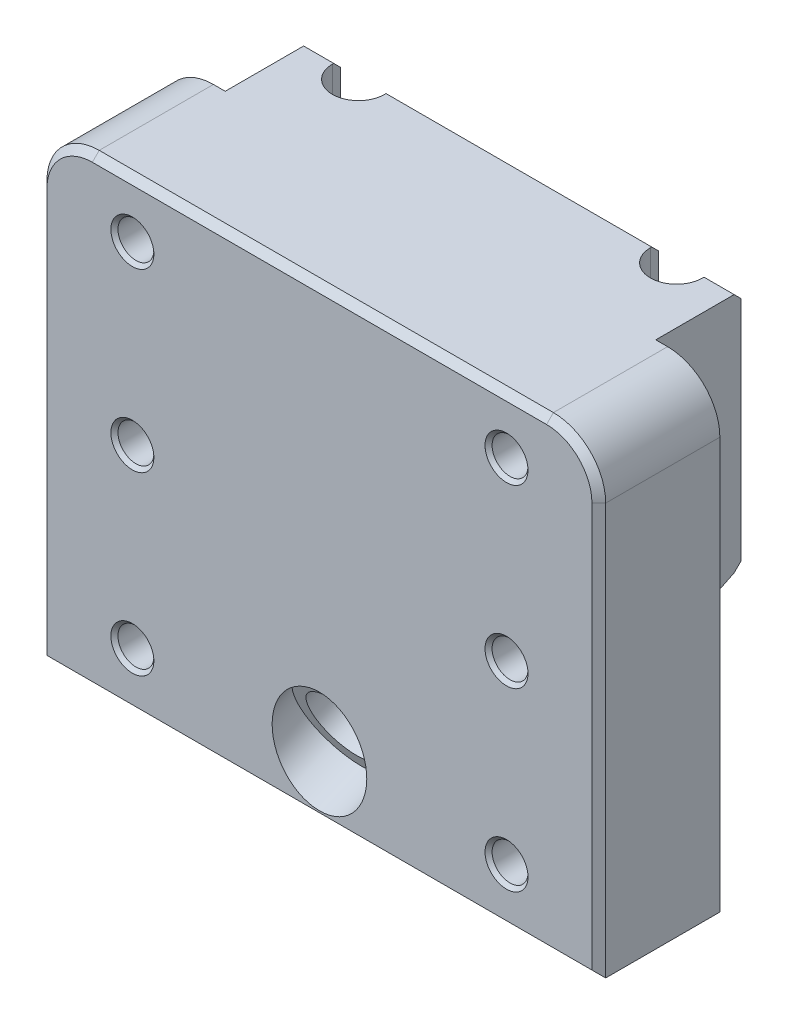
ISO-10303-21;
HEADER;
FILE_DESCRIPTION(('STEP AP214'),'2;1');
FILE_NAME('part.step','',(''),(''),'','','');
FILE_SCHEMA(('AUTOMOTIVE_DESIGN { 1 0 10303 214 1 1 1 1 }'));
ENDSEC;
DATA;
#1=APPLICATION_CONTEXT('core data for automotive mechanical design processes');
#2=APPLICATION_PROTOCOL_DEFINITION('international standard','automotive_design',2000,#1);
#3=PRODUCT_CONTEXT('',#1,'mechanical');
#4=PRODUCT('Part','Part','',(#3));
#5=PRODUCT_RELATED_PRODUCT_CATEGORY('part','',(#4));
#6=PRODUCT_DEFINITION_FORMATION('','',#4);
#7=PRODUCT_DEFINITION_CONTEXT('part definition',#1,'design');
#8=PRODUCT_DEFINITION('design','',#6,#7);
#9=PRODUCT_DEFINITION_SHAPE('','',#8);
#10=(LENGTH_UNIT() NAMED_UNIT(*) SI_UNIT(.MILLI.,.METRE.));
#11=(NAMED_UNIT(*) PLANE_ANGLE_UNIT() SI_UNIT($,.RADIAN.));
#12=(NAMED_UNIT(*) SI_UNIT($,.STERADIAN.) SOLID_ANGLE_UNIT());
#13=UNCERTAINTY_MEASURE_WITH_UNIT(LENGTH_MEASURE(1.E-05),#10,'distance_accuracy_value','');
#14=(GEOMETRIC_REPRESENTATION_CONTEXT(3) GLOBAL_UNCERTAINTY_ASSIGNED_CONTEXT((#13)) GLOBAL_UNIT_ASSIGNED_CONTEXT((#10,
#11,#12)) REPRESENTATION_CONTEXT('',''));
#15=CARTESIAN_POINT('',(0.,0.,0.));
#16=DIRECTION('',(0.,0.,1.));
#17=DIRECTION('',(1.,0.,0.));
#18=AXIS2_PLACEMENT_3D('',#15,#16,#17);
#19=CARTESIAN_POINT('',(39.751,85.598,-15.748));
#20=DIRECTION('',(0.,0.,1.));
#21=DIRECTION('',(1.,0.,0.));
#22=AXIS2_PLACEMENT_3D('',#19,#20,#21);
#23=PLANE('',#22);
#24=DIRECTION('',(0.,-1.,0.));
#25=VECTOR('',#24,1.);
#26=CARTESIAN_POINT('',(34.1884,85.598,-15.748));
#27=LINE('',#26,#25);
#28=CARTESIAN_POINT('',(34.1884,84.328,-15.748));
#29=VERTEX_POINT('',#28);
#30=CARTESIAN_POINT('',(34.1884,42.3652821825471,-15.748));
#31=VERTEX_POINT('',#30);
#32=EDGE_CURVE('E466',#29,#31,#27,.T.);
#33=ORIENTED_EDGE('',*,*,#32,.F.);
#34=DIRECTION('',(1.,0.,0.));
#35=VECTOR('',#34,1.);
#36=CARTESIAN_POINT('',(39.751,84.328,-15.748));
#37=LINE('',#36,#35);
#38=CARTESIAN_POINT('',(39.751,84.328,-15.748));
#39=VERTEX_POINT('',#38);
#40=EDGE_CURVE('E621',#29,#39,#37,.T.);
#41=ORIENTED_EDGE('',*,*,#40,.T.);
#42=DIRECTION('',(0.,-1.,0.));
#43=VECTOR('',#42,1.);
#44=CARTESIAN_POINT('',(39.751,85.598,-15.748));
#45=LINE('',#44,#43);
#46=CARTESIAN_POINT('',(39.751,42.3652821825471,-15.748));
#47=VERTEX_POINT('',#46);
#48=EDGE_CURVE('E755',#39,#47,#45,.T.);
#49=ORIENTED_EDGE('',*,*,#48,.T.);
#50=DIRECTION('',(-1.,0.,0.));
#51=VECTOR('',#50,1.);
#52=CARTESIAN_POINT('',(39.751,42.3652821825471,-15.748));
#53=LINE('',#52,#51);
#54=EDGE_CURVE('E791',#47,#31,#53,.T.);
#55=ORIENTED_EDGE('',*,*,#54,.T.);
#56=EDGE_LOOP('',(#33,#41,#49,#55));
#57=FACE_BOUND('',#56,.T.);
#58=ADVANCED_FACE('F16',(#57),#23,.F.);
#59=DIRECTION('',(0.,1.,0.));
#60=VECTOR('',#59,1.);
#61=CARTESIAN_POINT('',(24.5364,85.598,-15.748));
#62=LINE('',#61,#60);
#63=CARTESIAN_POINT('',(24.5364,42.3652821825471,-15.748));
#64=VERTEX_POINT('',#63);
#65=CARTESIAN_POINT('',(24.5364,84.328,-15.748));
#66=VERTEX_POINT('',#65);
#67=EDGE_CURVE('E460',#64,#66,#62,.T.);
#68=ORIENTED_EDGE('',*,*,#67,.F.);
#69=CARTESIAN_POINT('',(-24.5364,42.3652821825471,-15.748));
#70=VERTEX_POINT('',#69);
#71=EDGE_CURVE('E575',#64,#70,#53,.T.);
#72=ORIENTED_EDGE('',*,*,#71,.T.);
#73=DIRECTION('',(0.,1.,0.));
#74=VECTOR('',#73,1.);
#75=CARTESIAN_POINT('',(-24.5364,85.598,-15.748));
#76=LINE('',#75,#74);
#77=CARTESIAN_POINT('',(-24.5364,84.328,-15.748));
#78=VERTEX_POINT('',#77);
#79=EDGE_CURVE('E490',#70,#78,#76,.T.);
#80=ORIENTED_EDGE('',*,*,#79,.T.);
#81=EDGE_CURVE('E626',#78,#66,#37,.T.);
#82=ORIENTED_EDGE('',*,*,#81,.T.);
#83=EDGE_LOOP('',(#68,#72,#80,#82));
#84=FACE_BOUND('',#83,.T.);
#85=ADVANCED_FACE('F847',(#84),#23,.F.);
#86=CARTESIAN_POINT('',(39.751,42.3652821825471,-15.748));
#87=DIRECTION('',(0.,0.707106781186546,0.707106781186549));
#88=DIRECTION('',(0.,-0.707106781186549,0.707106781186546));
#89=AXIS2_PLACEMENT_3D('',#86,#87,#88);
#90=PLANE('',#89);
#91=DIRECTION('',(1.,0.,0.));
#92=VECTOR('',#91,1.);
#93=CARTESIAN_POINT('',(251.198420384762,41.1009034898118,-14.4836213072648));
#94=LINE('',#93,#92);
#95=CARTESIAN_POINT('',(34.1884,41.1009034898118,-14.4836213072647));
#96=VERTEX_POINT('',#95);
#97=CARTESIAN_POINT('',(39.751,41.1009034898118,-14.4836213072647));
#98=VERTEX_POINT('',#97);
#99=EDGE_CURVE('E579',#96,#98,#94,.T.);
#100=ORIENTED_EDGE('',*,*,#99,.F.);
#101=DIRECTION('',(0.,-0.707106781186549,0.707106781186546));
#102=VECTOR('',#101,1.);
#103=CARTESIAN_POINT('',(34.1884,42.3652821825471,-15.748));
#104=LINE('',#103,#102);
#105=EDGE_CURVE('E463',#96,#31,#104,.F.);
#106=ORIENTED_EDGE('',*,*,#105,.T.);
#107=ORIENTED_EDGE('',*,*,#54,.F.);
#108=DIRECTION('',(0.,-0.707106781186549,0.707106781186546));
#109=VECTOR('',#108,1.);
#110=CARTESIAN_POINT('',(39.751,42.3652821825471,-15.748));
#111=LINE('',#110,#109);
#112=EDGE_CURVE('E582',#98,#47,#111,.F.);
#113=ORIENTED_EDGE('',*,*,#112,.F.);
#114=EDGE_LOOP('',(#100,#106,#107,#113));
#115=FACE_BOUND('',#114,.T.);
#116=ADVANCED_FACE('F863',(#115),#90,.F.);
#117=ORIENTED_EDGE('',*,*,#71,.F.);
#118=DIRECTION('',(0.,0.707106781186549,-0.707106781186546));
#119=VECTOR('',#118,1.);
#120=CARTESIAN_POINT('',(24.5364,42.3652821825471,-15.748));
#121=LINE('',#120,#119);
#122=CARTESIAN_POINT('',(24.5364,41.1009034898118,-14.4836213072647));
#123=VERTEX_POINT('',#122);
#124=EDGE_CURVE('E456',#64,#123,#121,.F.);
#125=ORIENTED_EDGE('',*,*,#124,.T.);
#126=CARTESIAN_POINT('',(-24.5364,41.1009034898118,-14.4836213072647));
#127=VERTEX_POINT('',#126);
#128=EDGE_CURVE('E574',#127,#123,#94,.T.);
#129=ORIENTED_EDGE('',*,*,#128,.F.);
#130=DIRECTION('',(0.,0.707106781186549,-0.707106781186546));
#131=VECTOR('',#130,1.);
#132=CARTESIAN_POINT('',(-24.5364,42.3652821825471,-15.748));
#133=LINE('',#132,#131);
#134=EDGE_CURVE('E493',#70,#127,#133,.F.);
#135=ORIENTED_EDGE('',*,*,#134,.F.);
#136=EDGE_LOOP('',(#117,#125,#129,#135));
#137=FACE_BOUND('',#136,.T.);
#138=ADVANCED_FACE('F572',(#137),#90,.F.);
#139=CARTESIAN_POINT('',(-51.5874,85.598,-14.478));
#140=DIRECTION('',(0.,-0.707106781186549,0.707106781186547));
#141=DIRECTION('',(0.,-0.707106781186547,-0.707106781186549));
#142=AXIS2_PLACEMENT_3D('',#139,#140,#141);
#143=PLANE('',#142);
#144=ORIENTED_EDGE('',*,*,#40,.F.);
#145=DIRECTION('',(0.,-0.707106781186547,-0.707106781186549));
#146=VECTOR('',#145,1.);
#147=CARTESIAN_POINT('',(34.1884,85.598,-14.478));
#148=LINE('',#147,#146);
#149=CARTESIAN_POINT('',(34.1884,85.598,-14.478));
#150=VERTEX_POINT('',#149);
#151=EDGE_CURVE('E468',#29,#150,#148,.F.);
#152=ORIENTED_EDGE('',*,*,#151,.T.);
#153=DIRECTION('',(-1.,0.,0.));
#154=VECTOR('',#153,1.);
#155=CARTESIAN_POINT('',(-51.5874,85.598,-14.478));
#156=LINE('',#155,#154);
#157=CARTESIAN_POINT('',(39.751,85.598,-14.478));
#158=VERTEX_POINT('',#157);
#159=EDGE_CURVE('E616',#158,#150,#156,.T.);
#160=ORIENTED_EDGE('',*,*,#159,.F.);
#161=DIRECTION('',(0.,-0.707106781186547,-0.707106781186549));
#162=VECTOR('',#161,1.);
#163=CARTESIAN_POINT('',(39.751,85.598,-14.478));
#164=LINE('',#163,#162);
#165=EDGE_CURVE('E625',#39,#158,#164,.F.);
#166=ORIENTED_EDGE('',*,*,#165,.F.);
#167=EDGE_LOOP('',(#144,#152,#160,#166));
#168=FACE_BOUND('',#167,.T.);
#169=ADVANCED_FACE('F859',(#168),#143,.F.);
#170=CARTESIAN_POINT('',(24.5364,85.598,-14.478));
#171=VERTEX_POINT('',#170);
#172=CARTESIAN_POINT('',(-24.5364,85.598,-14.478));
#173=VERTEX_POINT('',#172);
#174=EDGE_CURVE('E619',#171,#173,#156,.T.);
#175=ORIENTED_EDGE('',*,*,#174,.F.);
#176=DIRECTION('',(0.,0.707106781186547,0.707106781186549));
#177=VECTOR('',#176,1.);
#178=CARTESIAN_POINT('',(24.5364,85.598,-14.478));
#179=LINE('',#178,#177);
#180=EDGE_CURVE('E447',#171,#66,#179,.F.);
#181=ORIENTED_EDGE('',*,*,#180,.T.);
#182=ORIENTED_EDGE('',*,*,#81,.F.);
#183=DIRECTION('',(0.,0.707106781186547,0.707106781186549));
#184=VECTOR('',#183,1.);
#185=CARTESIAN_POINT('',(-24.5364,85.598,-14.478));
#186=LINE('',#185,#184);
#187=EDGE_CURVE('E559',#173,#78,#186,.F.);
#188=ORIENTED_EDGE('',*,*,#187,.F.);
#189=EDGE_LOOP('',(#175,#181,#182,#188));
#190=FACE_BOUND('',#189,.T.);
#191=ADVANCED_FACE('F849',(#190),#143,.F.);
#192=CARTESIAN_POINT('',(-51.5874,85.598,22.352));
#193=DIRECTION('',(0.,-1.,0.));
#194=DIRECTION('',(0.,0.,-1.));
#195=AXIS2_PLACEMENT_3D('',#192,#193,#194);
#196=PLANE('',#195);
#197=DIRECTION('',(0.,0.,1.));
#198=VECTOR('',#197,1.);
#199=CARTESIAN_POINT('',(34.1884,85.598,-19.6026881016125));
#200=LINE('',#199,#198);
#201=CARTESIAN_POINT('',(34.1884,85.598,-14.224));
#202=VERTEX_POINT('',#201);
#203=EDGE_CURVE('E441',#150,#202,#200,.T.);
#204=ORIENTED_EDGE('',*,*,#203,.T.);
#205=CARTESIAN_POINT('',(29.3624,85.598,-14.224));
#206=DIRECTION('',(0.,-1.,0.));
#207=DIRECTION('',(0.,0.,1.));
#208=AXIS2_PLACEMENT_3D('',#205,#206,#207);
#209=CIRCLE('',#208,4.826);
#210=CARTESIAN_POINT('',(24.5364,85.598,-14.224));
#211=VERTEX_POINT('',#210);
#212=EDGE_CURVE('E436',#202,#211,#209,.T.);
#213=ORIENTED_EDGE('',*,*,#212,.T.);
#214=DIRECTION('',(0.,0.,-1.));
#215=VECTOR('',#214,1.);
#216=CARTESIAN_POINT('',(24.5364,85.598,-14.224));
#217=LINE('',#216,#215);
#218=EDGE_CURVE('E444',#211,#171,#217,.T.);
#219=ORIENTED_EDGE('',*,*,#218,.T.);
#220=ORIENTED_EDGE('',*,*,#174,.T.);
#221=DIRECTION('',(0.,0.,-1.));
#222=VECTOR('',#221,1.);
#223=CARTESIAN_POINT('',(-24.5364,85.598,-14.224));
#224=LINE('',#223,#222);
#225=CARTESIAN_POINT('',(-24.5364,85.598,-14.224));
#226=VERTEX_POINT('',#225);
#227=EDGE_CURVE('E477',#226,#173,#224,.T.);
#228=ORIENTED_EDGE('',*,*,#227,.F.);
#229=CARTESIAN_POINT('',(-29.3624,85.598,-14.224));
#230=DIRECTION('',(0.,1.,0.));
#231=DIRECTION('',(0.,0.,1.));
#232=AXIS2_PLACEMENT_3D('',#229,#230,#231);
#233=CIRCLE('',#232,4.826);
#234=CARTESIAN_POINT('',(-34.1884,85.598,-14.224));
#235=VERTEX_POINT('',#234);
#236=EDGE_CURVE('E474',#235,#226,#233,.T.);
#237=ORIENTED_EDGE('',*,*,#236,.F.);
#238=DIRECTION('',(0.,0.,1.));
#239=VECTOR('',#238,1.);
#240=CARTESIAN_POINT('',(-34.1884,85.598,-19.6026881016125));
#241=LINE('',#240,#239);
#242=CARTESIAN_POINT('',(-34.1884,85.598,-14.478));
#243=VERTEX_POINT('',#242);
#244=EDGE_CURVE('E471',#243,#235,#241,.T.);
#245=ORIENTED_EDGE('',*,*,#244,.F.);
#246=CARTESIAN_POINT('',(-39.751,85.598,-14.478));
#247=VERTEX_POINT('',#246);
#248=EDGE_CURVE('E615',#243,#247,#156,.T.);
#249=ORIENTED_EDGE('',*,*,#248,.T.);
#250=DIRECTION('',(0.,0.,1.));
#251=VECTOR('',#250,1.);
#252=CARTESIAN_POINT('',(-39.751,85.598,0.));
#253=LINE('',#252,#251);
#254=CARTESIAN_POINT('',(-39.751,85.598,0.));
#255=VERTEX_POINT('',#254);
#256=EDGE_CURVE('E771',#247,#255,#253,.T.);
#257=ORIENTED_EDGE('',*,*,#256,.T.);
#258=DIRECTION('',(-1.,0.,0.));
#259=VECTOR('',#258,1.);
#260=CARTESIAN_POINT('',(51.5874,85.598,0.));
#261=LINE('',#260,#259);
#262=CARTESIAN_POINT('',(-41.9354,85.598,0.));
#263=VERTEX_POINT('',#262);
#264=EDGE_CURVE('E742',#255,#263,#261,.T.);
#265=ORIENTED_EDGE('',*,*,#264,.T.);
#266=DIRECTION('',(0.,0.,-1.));
#267=VECTOR('',#266,1.);
#268=CARTESIAN_POINT('',(-41.9354,85.598,22.352));
#269=LINE('',#268,#267);
#270=CARTESIAN_POINT('',(-41.9354,85.598,21.082));
#271=VERTEX_POINT('',#270);
#272=EDGE_CURVE('E749',#263,#271,#269,.F.);
#273=ORIENTED_EDGE('',*,*,#272,.T.);
#274=DIRECTION('',(1.,0.,0.));
#275=VECTOR('',#274,1.);
#276=CARTESIAN_POINT('',(-51.5874,85.598,21.082));
#277=LINE('',#276,#275);
#278=CARTESIAN_POINT('',(41.9354,85.598,21.082));
#279=VERTEX_POINT('',#278);
#280=EDGE_CURVE('E613',#271,#279,#277,.T.);
#281=ORIENTED_EDGE('',*,*,#280,.T.);
#282=DIRECTION('',(0.,0.,-1.));
#283=VECTOR('',#282,1.);
#284=CARTESIAN_POINT('',(41.9354,85.598,22.352));
#285=LINE('',#284,#283);
#286=CARTESIAN_POINT('',(41.9354,85.598,0.));
#287=VERTEX_POINT('',#286);
#288=EDGE_CURVE('E768',#279,#287,#285,.T.);
#289=ORIENTED_EDGE('',*,*,#288,.T.);
#290=CARTESIAN_POINT('',(39.751,85.598,0.));
#291=VERTEX_POINT('',#290);
#292=EDGE_CURVE('E745',#287,#291,#261,.T.);
#293=ORIENTED_EDGE('',*,*,#292,.T.);
#294=DIRECTION('',(0.,0.,1.));
#295=VECTOR('',#294,1.);
#296=CARTESIAN_POINT('',(39.751,85.598,0.));
#297=LINE('',#296,#295);
#298=EDGE_CURVE('E730',#158,#291,#297,.T.);
#299=ORIENTED_EDGE('',*,*,#298,.F.);
#300=ORIENTED_EDGE('',*,*,#159,.T.);
#301=EDGE_LOOP('',(#204,#213,#219,#220,#228,#237,#245,#249,#257,#265,#273,#281,#289,#293,#299,#300));
#302=FACE_BOUND('',#301,.T.);
#303=ADVANCED_FACE('F451',(#302),#196,.F.);
#304=CARTESIAN_POINT('',(251.198420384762,34.036769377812,0.));
#305=DIRECTION('',(0.,0.898794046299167,0.438371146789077));
#306=DIRECTION('',(0.,-0.438371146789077,0.898794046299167));
#307=AXIS2_PLACEMENT_3D('',#304,#305,#306);
#308=PLANE('',#307);
#309=DIRECTION('',(0.,-0.438371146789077,0.898794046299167));
#310=VECTOR('',#309,1.);
#311=CARTESIAN_POINT('',(34.1884,34.036769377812,-2.26303410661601E-13));
#312=LINE('',#311,#310);
#313=CARTESIAN_POINT('',(34.1884,40.9742777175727,-14.224));
#314=VERTEX_POINT('',#313);
#315=EDGE_CURVE('E10',#96,#314,#312,.T.);
#316=ORIENTED_EDGE('',*,*,#315,.F.);
#317=ORIENTED_EDGE('',*,*,#99,.T.);
#318=DIRECTION('',(0.,0.438371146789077,-0.898794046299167));
#319=VECTOR('',#318,1.);
#320=CARTESIAN_POINT('',(39.751,43.9452530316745,-20.3154020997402));
#321=LINE('',#320,#319);
#322=CARTESIAN_POINT('',(39.751,34.7325381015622,-1.42653728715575));
#323=VERTEX_POINT('',#322);
#324=EDGE_CURVE('E731',#323,#98,#321,.T.);
#325=ORIENTED_EDGE('',*,*,#324,.F.);
#326=DIRECTION('',(-1.,0.,0.));
#327=VECTOR('',#326,1.);
#328=CARTESIAN_POINT('',(-39.751,34.7325381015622,-1.42653728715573));
#329=LINE('',#328,#327);
#330=CARTESIAN_POINT('',(-39.751,34.7325381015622,-1.42653728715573));
#331=VERTEX_POINT('',#330);
#332=EDGE_CURVE('E628',#323,#331,#329,.T.);
#333=ORIENTED_EDGE('',*,*,#332,.T.);
#334=DIRECTION('',(0.,0.438371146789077,-0.898794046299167));
#335=VECTOR('',#334,1.);
#336=CARTESIAN_POINT('',(-39.751,43.9452530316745,-20.3154020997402));
#337=LINE('',#336,#335);
#338=CARTESIAN_POINT('',(-39.751,41.1009034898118,-14.4836213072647));
#339=VERTEX_POINT('',#338);
#340=EDGE_CURVE('E734',#331,#339,#337,.T.);
#341=ORIENTED_EDGE('',*,*,#340,.T.);
#342=CARTESIAN_POINT('',(-34.1884,41.1009034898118,-14.4836213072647));
#343=VERTEX_POINT('',#342);
#344=EDGE_CURVE('E578',#339,#343,#94,.T.);
#345=ORIENTED_EDGE('',*,*,#344,.T.);
#346=DIRECTION('',(0.,-0.438371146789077,0.898794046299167));
#347=VECTOR('',#346,1.);
#348=CARTESIAN_POINT('',(-34.1884,34.0367693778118,2.97274311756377E-13));
#349=LINE('',#348,#347);
#350=CARTESIAN_POINT('',(-34.1884,40.9742777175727,-14.224));
#351=VERTEX_POINT('',#350);
#352=EDGE_CURVE('E487',#343,#351,#349,.T.);
#353=ORIENTED_EDGE('',*,*,#352,.T.);
#354=CARTESIAN_POINT('',(-29.3624,40.9742777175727,-14.224));
#355=DIRECTION('',(0.,0.898794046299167,0.438371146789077));
#356=DIRECTION('',(0.,0.438371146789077,-0.898794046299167));
#357=AXIS2_PLACEMENT_3D('',#354,#355,#356);
#358=ELLIPSE('',#357,5.36941696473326,4.826);
#359=CARTESIAN_POINT('',(-24.5364,40.9742777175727,-14.224));
#360=VERTEX_POINT('',#359);
#361=EDGE_CURVE('E562',#351,#360,#358,.T.);
#362=ORIENTED_EDGE('',*,*,#361,.T.);
#363=DIRECTION('',(0.,0.438371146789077,-0.898794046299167));
#364=VECTOR('',#363,1.);
#365=CARTESIAN_POINT('',(-24.5364,34.0367693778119,1.43535532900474E-13));
#366=LINE('',#365,#364);
#367=EDGE_CURVE('E495',#360,#127,#366,.T.);
#368=ORIENTED_EDGE('',*,*,#367,.T.);
#369=ORIENTED_EDGE('',*,*,#128,.T.);
#370=DIRECTION('',(0.,0.438371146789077,-0.898794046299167));
#371=VECTOR('',#370,1.);
#372=CARTESIAN_POINT('',(24.5364,34.036769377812,-1.18253328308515E-13));
#373=LINE('',#372,#371);
#374=CARTESIAN_POINT('',(24.5364,40.9742777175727,-14.224));
#375=VERTEX_POINT('',#374);
#376=EDGE_CURVE('E565',#375,#123,#373,.T.);
#377=ORIENTED_EDGE('',*,*,#376,.F.);
#378=CARTESIAN_POINT('',(29.3624,40.9742777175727,-14.224));
#379=DIRECTION('',(0.,0.898794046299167,0.438371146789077));
#380=DIRECTION('',(0.,0.438371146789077,-0.898794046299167));
#381=AXIS2_PLACEMENT_3D('',#378,#379,#380);
#382=ELLIPSE('',#381,5.36941696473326,4.826);
#383=EDGE_CURVE('E24',#314,#375,#382,.F.);
#384=ORIENTED_EDGE('',*,*,#383,.F.);
#385=EDGE_LOOP('',(#316,#317,#325,#333,#341,#345,#353,#362,#368,#369,#377,#384));
#386=FACE_BOUND('',#385,.T.);
#387=ADVANCED_FACE('F577',(#386),#308,.F.);
#388=CARTESIAN_POINT('',(0.,85.598,22.352));
#389=DIRECTION('',(0.,0.,-1.));
#390=DIRECTION('',(-1.,0.,0.));
#391=AXIS2_PLACEMENT_3D('',#388,#389,#390);
#392=PLANE('',#391);
#393=DIRECTION('',(0.999999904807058,-0.00043633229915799,0.));
#394=VECTOR('',#393,1.);
#395=CARTESIAN_POINT('',(-30.575250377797,42.7972683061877,22.352));
#396=LINE('',#395,#394);
#397=CARTESIAN_POINT('',(-30.5749963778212,42.7972681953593,22.352));
#398=VERTEX_POINT('',#397);
#399=CARTESIAN_POINT('',(-30.575250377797,42.7972683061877,22.352));
#400=VERTEX_POINT('',#399);
#401=EDGE_CURVE('E2031',#398,#400,#396,.F.);
#402=ORIENTED_EDGE('',*,*,#401,.F.);
#403=CARTESIAN_POINT('',(-34.544,42.799,22.352));
#404=DIRECTION('',(0.,0.,1.));
#405=DIRECTION('',(1.,0.,0.));
#406=AXIS2_PLACEMENT_3D('',#403,#404,#405);
#407=CIRCLE('',#406,3.969004);
#408=CARTESIAN_POINT('',(-30.574996,42.799,22.352));
#409=VERTEX_POINT('',#408);
#410=EDGE_CURVE('E2009',#409,#398,#407,.T.);
#411=ORIENTED_EDGE('',*,*,#410,.F.);
#412=DIRECTION('',(1.,0.,0.));
#413=VECTOR('',#412,1.);
#414=CARTESIAN_POINT('',(-30.57525,42.799,22.352));
#415=LINE('',#414,#413);
#416=CARTESIAN_POINT('',(-30.57525,42.799,22.352));
#417=VERTEX_POINT('',#416);
#418=EDGE_CURVE('E2027',#409,#417,#415,.F.);
#419=ORIENTED_EDGE('',*,*,#418,.T.);
#420=CARTESIAN_POINT('',(-34.544,42.799,22.352));
#421=DIRECTION('',(0.,0.,-1.));
#422=DIRECTION('',(-1.,0.,0.));
#423=AXIS2_PLACEMENT_3D('',#420,#421,#422);
#424=CIRCLE('',#423,3.96875);
#425=EDGE_CURVE('E2026',#417,#400,#424,.T.);
#426=ORIENTED_EDGE('',*,*,#425,.T.);
#427=EDGE_LOOP('',(#402,#411,#419,#426));
#428=FACE_BOUND('',#427,.T.);
#429=DIRECTION('',(0.999999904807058,-0.00043633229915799,0.));
#430=VECTOR('',#429,1.);
#431=CARTESIAN_POINT('',(-30.575250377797,10.2852683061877,22.352));
#432=LINE('',#431,#430);
#433=CARTESIAN_POINT('',(-30.5749963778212,10.2852681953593,22.352));
#434=VERTEX_POINT('',#433);
#435=CARTESIAN_POINT('',(-30.575250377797,10.2852683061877,22.352));
#436=VERTEX_POINT('',#435);
#437=EDGE_CURVE('E2173',#434,#436,#432,.F.);
#438=ORIENTED_EDGE('',*,*,#437,.F.);
#439=CARTESIAN_POINT('',(-34.544,10.287,22.352));
#440=DIRECTION('',(0.,0.,1.));
#441=DIRECTION('',(1.,0.,0.));
#442=AXIS2_PLACEMENT_3D('',#439,#440,#441);
#443=CIRCLE('',#442,3.969004);
#444=CARTESIAN_POINT('',(-30.574996,10.287,22.352));
#445=VERTEX_POINT('',#444);
#446=EDGE_CURVE('E2359',#445,#434,#443,.T.);
#447=ORIENTED_EDGE('',*,*,#446,.F.);
#448=DIRECTION('',(1.,0.,0.));
#449=VECTOR('',#448,1.);
#450=CARTESIAN_POINT('',(-30.57525,10.287,22.352));
#451=LINE('',#450,#449);
#452=CARTESIAN_POINT('',(-30.57525,10.287,22.352));
#453=VERTEX_POINT('',#452);
#454=EDGE_CURVE('E2254',#445,#453,#451,.F.);
#455=ORIENTED_EDGE('',*,*,#454,.T.);
#456=CARTESIAN_POINT('',(-34.544,10.287,22.352));
#457=DIRECTION('',(0.,0.,-1.));
#458=DIRECTION('',(-1.,0.,0.));
#459=AXIS2_PLACEMENT_3D('',#456,#457,#458);
#460=CIRCLE('',#459,3.96875);
#461=EDGE_CURVE('E642',#453,#436,#460,.T.);
#462=ORIENTED_EDGE('',*,*,#461,.T.);
#463=EDGE_LOOP('',(#438,#447,#455,#462));
#464=FACE_BOUND('',#463,.T.);
#465=DIRECTION('',(0.999999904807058,-0.00043633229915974,0.));
#466=VECTOR('',#465,1.);
#467=CARTESIAN_POINT('',(38.512749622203,42.7972683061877,22.352));
#468=LINE('',#467,#466);
#469=CARTESIAN_POINT('',(38.5130036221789,42.7972681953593,22.352));
#470=VERTEX_POINT('',#469);
#471=CARTESIAN_POINT('',(38.512749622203,42.7972683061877,22.352));
#472=VERTEX_POINT('',#471);
#473=EDGE_CURVE('E676',#470,#472,#468,.F.);
#474=ORIENTED_EDGE('',*,*,#473,.F.);
#475=CARTESIAN_POINT('',(34.544,42.799,22.352));
#476=DIRECTION('',(0.,0.,1.));
#477=DIRECTION('',(1.,0.,0.));
#478=AXIS2_PLACEMENT_3D('',#475,#476,#477);
#479=CIRCLE('',#478,3.969004);
#480=CARTESIAN_POINT('',(38.513004,42.799,22.352));
#481=VERTEX_POINT('',#480);
#482=EDGE_CURVE('E2177',#481,#470,#479,.T.);
#483=ORIENTED_EDGE('',*,*,#482,.F.);
#484=DIRECTION('',(1.,0.,0.));
#485=VECTOR('',#484,1.);
#486=CARTESIAN_POINT('',(38.51275,42.799,22.352));
#487=LINE('',#486,#485);
#488=CARTESIAN_POINT('',(38.51275,42.799,22.352));
#489=VERTEX_POINT('',#488);
#490=EDGE_CURVE('E680',#481,#489,#487,.F.);
#491=ORIENTED_EDGE('',*,*,#490,.T.);
#492=CARTESIAN_POINT('',(34.544,42.799,22.352));
#493=DIRECTION('',(0.,0.,-1.));
#494=DIRECTION('',(-1.,0.,0.));
#495=AXIS2_PLACEMENT_3D('',#492,#493,#494);
#496=CIRCLE('',#495,3.96875);
#497=EDGE_CURVE('E658',#489,#472,#496,.T.);
#498=ORIENTED_EDGE('',*,*,#497,.T.);
#499=EDGE_LOOP('',(#474,#483,#491,#498));
#500=FACE_BOUND('',#499,.T.);
#501=DIRECTION('',(0.,1.,0.));
#502=VECTOR('',#501,1.);
#503=CARTESIAN_POINT('',(50.3174,85.598,22.352));
#504=LINE('',#503,#502);
#505=CARTESIAN_POINT('',(50.3174,1.27,22.352));
#506=VERTEX_POINT('',#505);
#507=CARTESIAN_POINT('',(50.3174,75.946,22.352));
#508=VERTEX_POINT('',#507);
#509=EDGE_CURVE('E597',#506,#508,#504,.T.);
#510=ORIENTED_EDGE('',*,*,#509,.T.);
#511=CARTESIAN_POINT('',(41.9354,75.946,22.352));
#512=DIRECTION('',(0.,0.,-1.));
#513=DIRECTION('',(-1.,0.,0.));
#514=AXIS2_PLACEMENT_3D('',#511,#512,#513);
#515=CIRCLE('',#514,8.382);
#516=CARTESIAN_POINT('',(41.9354,84.328,22.352));
#517=VERTEX_POINT('',#516);
#518=EDGE_CURVE('E599',#508,#517,#515,.F.);
#519=ORIENTED_EDGE('',*,*,#518,.T.);
#520=DIRECTION('',(-1.,0.,0.));
#521=VECTOR('',#520,1.);
#522=CARTESIAN_POINT('',(0.,84.328,22.352));
#523=LINE('',#522,#521);
#524=CARTESIAN_POINT('',(-41.9354,84.328,22.352));
#525=VERTEX_POINT('',#524);
#526=EDGE_CURVE('E589',#517,#525,#523,.T.);
#527=ORIENTED_EDGE('',*,*,#526,.T.);
#528=CARTESIAN_POINT('',(-41.9354,75.946,22.352));
#529=DIRECTION('',(0.,0.,-1.));
#530=DIRECTION('',(-1.,0.,0.));
#531=AXIS2_PLACEMENT_3D('',#528,#529,#530);
#532=CIRCLE('',#531,8.382);
#533=CARTESIAN_POINT('',(-50.3174,75.946,22.352));
#534=VERTEX_POINT('',#533);
#535=EDGE_CURVE('E591',#525,#534,#532,.F.);
#536=ORIENTED_EDGE('',*,*,#535,.T.);
#537=DIRECTION('',(0.,-1.,0.));
#538=VECTOR('',#537,1.);
#539=CARTESIAN_POINT('',(-50.3174,0.,22.352));
#540=LINE('',#539,#538);
#541=CARTESIAN_POINT('',(-50.3174,1.27,22.352));
#542=VERTEX_POINT('',#541);
#543=EDGE_CURVE('E593',#534,#542,#540,.T.);
#544=ORIENTED_EDGE('',*,*,#543,.T.);
#545=DIRECTION('',(1.,0.,0.));
#546=VECTOR('',#545,1.);
#547=CARTESIAN_POINT('',(51.5874,1.27,22.352));
#548=LINE('',#547,#546);
#549=EDGE_CURVE('E595',#542,#506,#548,.T.);
#550=ORIENTED_EDGE('',*,*,#549,.T.);
#551=EDGE_LOOP('',(#510,#519,#527,#536,#544,#550));
#552=FACE_BOUND('',#551,.T.);
#553=CARTESIAN_POINT('',(0.,11.0730822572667,22.352));
#554=DIRECTION('',(0.,0.,-1.));
#555=DIRECTION('',(0.,1.,0.));
#556=AXIS2_PLACEMENT_3D('',#553,#554,#555);
#557=ELLIPSE('',#556,9.49218243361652,8.7376);
#558=CARTESIAN_POINT('',(0.,20.5652646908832,22.352));
#559=VERTEX_POINT('',#558);
#560=EDGE_CURVE('E735',#559,#559,#557,.F.);
#561=ORIENTED_EDGE('',*,*,#560,.F.);
#562=EDGE_LOOP('',(#561));
#563=FACE_BOUND('',#562,.T.);
#564=DIRECTION('',(0.999999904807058,-0.000436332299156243,0.));
#565=VECTOR('',#564,1.);
#566=CARTESIAN_POINT('',(38.512749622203,75.3092683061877,22.352));
#567=LINE('',#566,#565);
#568=CARTESIAN_POINT('',(38.5130036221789,75.3092681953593,22.352));
#569=VERTEX_POINT('',#568);
#570=CARTESIAN_POINT('',(38.512749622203,75.3092683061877,22.352));
#571=VERTEX_POINT('',#570);
#572=EDGE_CURVE('E1991',#569,#571,#567,.F.);
#573=ORIENTED_EDGE('',*,*,#572,.F.);
#574=CARTESIAN_POINT('',(34.544,75.311,22.352));
#575=DIRECTION('',(0.,0.,1.));
#576=DIRECTION('',(1.,0.,0.));
#577=AXIS2_PLACEMENT_3D('',#574,#575,#576);
#578=CIRCLE('',#577,3.969004);
#579=CARTESIAN_POINT('',(38.513004,75.311,22.352));
#580=VERTEX_POINT('',#579);
#581=EDGE_CURVE('E2276',#580,#569,#578,.T.);
#582=ORIENTED_EDGE('',*,*,#581,.F.);
#583=DIRECTION('',(1.,0.,0.));
#584=VECTOR('',#583,1.);
#585=CARTESIAN_POINT('',(38.51275,75.311,22.352));
#586=LINE('',#585,#584);
#587=CARTESIAN_POINT('',(38.51275,75.311,22.352));
#588=VERTEX_POINT('',#587);
#589=EDGE_CURVE('E2232',#580,#588,#586,.F.);
#590=ORIENTED_EDGE('',*,*,#589,.T.);
#591=CARTESIAN_POINT('',(34.544,75.311,22.352));
#592=DIRECTION('',(0.,0.,-1.));
#593=DIRECTION('',(-1.,0.,0.));
#594=AXIS2_PLACEMENT_3D('',#591,#592,#593);
#595=CIRCLE('',#594,3.96875);
#596=EDGE_CURVE('E661',#588,#571,#595,.T.);
#597=ORIENTED_EDGE('',*,*,#596,.T.);
#598=EDGE_LOOP('',(#573,#582,#590,#597));
#599=FACE_BOUND('',#598,.T.);
#600=DIRECTION('',(0.999999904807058,-0.000436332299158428,0.));
#601=VECTOR('',#600,1.);
#602=CARTESIAN_POINT('',(38.512749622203,10.2852683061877,22.352));
#603=LINE('',#602,#601);
#604=CARTESIAN_POINT('',(38.5130036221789,10.2852681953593,22.352));
#605=VERTEX_POINT('',#604);
#606=CARTESIAN_POINT('',(38.512749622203,10.2852683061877,22.352));
#607=VERTEX_POINT('',#606);
#608=EDGE_CURVE('E1997',#605,#607,#603,.F.);
#609=ORIENTED_EDGE('',*,*,#608,.F.);
#610=CARTESIAN_POINT('',(34.544,10.287,22.352));
#611=DIRECTION('',(0.,0.,1.));
#612=DIRECTION('',(1.,0.,0.));
#613=AXIS2_PLACEMENT_3D('',#610,#611,#612);
#614=CIRCLE('',#613,3.969004);
#615=CARTESIAN_POINT('',(38.513004,10.287,22.352));
#616=VERTEX_POINT('',#615);
#617=EDGE_CURVE('E2044',#616,#605,#614,.T.);
#618=ORIENTED_EDGE('',*,*,#617,.F.);
#619=DIRECTION('',(1.,0.,0.));
#620=VECTOR('',#619,1.);
#621=CARTESIAN_POINT('',(38.51275,10.287,22.352));
#622=LINE('',#621,#620);
#623=CARTESIAN_POINT('',(38.51275,10.287,22.352));
#624=VERTEX_POINT('',#623);
#625=EDGE_CURVE('E2086',#616,#624,#622,.F.);
#626=ORIENTED_EDGE('',*,*,#625,.T.);
#627=CARTESIAN_POINT('',(34.544,10.287,22.352));
#628=DIRECTION('',(0.,0.,-1.));
#629=DIRECTION('',(-1.,0.,0.));
#630=AXIS2_PLACEMENT_3D('',#627,#628,#629);
#631=CIRCLE('',#630,3.96875);
#632=EDGE_CURVE('E647',#624,#607,#631,.T.);
#633=ORIENTED_EDGE('',*,*,#632,.T.);
#634=EDGE_LOOP('',(#609,#618,#626,#633));
#635=FACE_BOUND('',#634,.T.);
#636=DIRECTION('',(0.999999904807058,-0.000436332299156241,0.));
#637=VECTOR('',#636,1.);
#638=CARTESIAN_POINT('',(-30.575250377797,75.3092683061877,22.352));
#639=LINE('',#638,#637);
#640=CARTESIAN_POINT('',(-30.5749963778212,75.3092681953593,22.352));
#641=VERTEX_POINT('',#640);
#642=CARTESIAN_POINT('',(-30.575250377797,75.3092683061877,22.352));
#643=VERTEX_POINT('',#642);
#644=EDGE_CURVE('E554',#641,#643,#639,.F.);
#645=ORIENTED_EDGE('',*,*,#644,.F.);
#646=CARTESIAN_POINT('',(-34.544,75.311,22.352));
#647=DIRECTION('',(0.,0.,1.));
#648=DIRECTION('',(1.,0.,0.));
#649=AXIS2_PLACEMENT_3D('',#646,#647,#648);
#650=CIRCLE('',#649,3.969004);
#651=CARTESIAN_POINT('',(-30.574996,75.311,22.352));
#652=VERTEX_POINT('',#651);
#653=EDGE_CURVE('E504',#652,#641,#650,.T.);
#654=ORIENTED_EDGE('',*,*,#653,.F.);
#655=DIRECTION('',(1.,0.,0.));
#656=VECTOR('',#655,1.);
#657=CARTESIAN_POINT('',(-30.57525,75.311,22.352));
#658=LINE('',#657,#656);
#659=CARTESIAN_POINT('',(-30.57525,75.311,22.352));
#660=VERTEX_POINT('',#659);
#661=EDGE_CURVE('E545',#652,#660,#658,.F.);
#662=ORIENTED_EDGE('',*,*,#661,.T.);
#663=CARTESIAN_POINT('',(-34.544,75.311,22.352));
#664=DIRECTION('',(0.,0.,-1.));
#665=DIRECTION('',(-1.,0.,0.));
#666=AXIS2_PLACEMENT_3D('',#663,#664,#665);
#667=CIRCLE('',#666,3.96875);
#668=EDGE_CURVE('E2003',#660,#643,#667,.T.);
#669=ORIENTED_EDGE('',*,*,#668,.T.);
#670=EDGE_LOOP('',(#645,#654,#662,#669));
#671=FACE_BOUND('',#670,.T.);
#672=ADVANCED_FACE('F894',(#428,#464,#500,#552,#563,#599,#635,#671),#392,.F.);
#673=CARTESIAN_POINT('',(-39.751,85.598,0.));
#674=DIRECTION('',(-1.,0.,0.));
#675=DIRECTION('',(0.,0.,1.));
#676=AXIS2_PLACEMENT_3D('',#673,#674,#675);
#677=PLANE('',#676);
#678=ORIENTED_EDGE('',*,*,#256,.F.);
#679=DIRECTION('',(0.,0.707106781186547,0.707106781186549));
#680=VECTOR('',#679,1.);
#681=CARTESIAN_POINT('',(-39.751,92.837,-7.239));
#682=LINE('',#681,#680);
#683=CARTESIAN_POINT('',(-39.751,84.328,-15.748));
#684=VERTEX_POINT('',#683);
#685=EDGE_CURVE('E618',#247,#684,#682,.F.);
#686=ORIENTED_EDGE('',*,*,#685,.T.);
#687=DIRECTION('',(0.,-1.,0.));
#688=VECTOR('',#687,1.);
#689=CARTESIAN_POINT('',(-39.751,85.598,-15.748));
#690=LINE('',#689,#688);
#691=CARTESIAN_POINT('',(-39.751,42.3652821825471,-15.748));
#692=VERTEX_POINT('',#691);
#693=EDGE_CURVE('E752',#684,#692,#690,.T.);
#694=ORIENTED_EDGE('',*,*,#693,.T.);
#695=DIRECTION('',(0.,0.707106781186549,-0.707106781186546));
#696=VECTOR('',#695,1.);
#697=CARTESIAN_POINT('',(-39.751,56.1076410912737,-29.4903589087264));
#698=LINE('',#697,#696);
#699=EDGE_CURVE('E583',#692,#339,#698,.F.);
#700=ORIENTED_EDGE('',*,*,#699,.T.);
#701=ORIENTED_EDGE('',*,*,#340,.F.);
#702=CARTESIAN_POINT('',(-39.751,32.4496012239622,-2.54));
#703=DIRECTION('',(-1.,0.,0.));
#704=DIRECTION('',(0.,0.,1.));
#705=AXIS2_PLACEMENT_3D('',#702,#703,#704);
#706=CIRCLE('',#705,2.54);
#707=CARTESIAN_POINT('',(-39.751,32.4496012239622,0.));
#708=VERTEX_POINT('',#707);
#709=EDGE_CURVE('E634',#331,#708,#706,.F.);
#710=ORIENTED_EDGE('',*,*,#709,.T.);
#711=DIRECTION('',(0.,-1.,0.));
#712=VECTOR('',#711,1.);
#713=CARTESIAN_POINT('',(-39.751,85.598,0.));
#714=LINE('',#713,#712);
#715=EDGE_CURVE('E750',#255,#708,#714,.T.);
#716=ORIENTED_EDGE('',*,*,#715,.F.);
#717=EDGE_LOOP('',(#678,#686,#694,#700,#701,#710,#716));
#718=FACE_BOUND('',#717,.T.);
#719=ADVANCED_FACE('F807',(#718),#677,.T.);
#720=CARTESIAN_POINT('',(39.751,85.598,0.));
#721=DIRECTION('',(-1.,0.,0.));
#722=DIRECTION('',(0.,0.,1.));
#723=AXIS2_PLACEMENT_3D('',#720,#721,#722);
#724=PLANE('',#723);
#725=ORIENTED_EDGE('',*,*,#48,.F.);
#726=ORIENTED_EDGE('',*,*,#165,.T.);
#727=ORIENTED_EDGE('',*,*,#298,.T.);
#728=DIRECTION('',(0.,-1.,0.));
#729=VECTOR('',#728,1.);
#730=CARTESIAN_POINT('',(39.751,85.598,0.));
#731=LINE('',#730,#729);
#732=CARTESIAN_POINT('',(39.751,32.4496012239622,0.));
#733=VERTEX_POINT('',#732);
#734=EDGE_CURVE('E757',#291,#733,#731,.T.);
#735=ORIENTED_EDGE('',*,*,#734,.T.);
#736=CARTESIAN_POINT('',(39.751,32.4496012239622,-2.54));
#737=DIRECTION('',(-1.,0.,0.));
#738=DIRECTION('',(0.,0.,1.));
#739=AXIS2_PLACEMENT_3D('',#736,#737,#738);
#740=CIRCLE('',#739,2.54);
#741=EDGE_CURVE('E637',#733,#323,#740,.T.);
#742=ORIENTED_EDGE('',*,*,#741,.T.);
#743=ORIENTED_EDGE('',*,*,#324,.T.);
#744=ORIENTED_EDGE('',*,*,#112,.T.);
#745=EDGE_LOOP('',(#725,#726,#727,#735,#742,#743,#744));
#746=FACE_BOUND('',#745,.T.);
#747=ADVANCED_FACE('F855',(#746),#724,.F.);
#748=CARTESIAN_POINT('',(-34.1884,84.328,-15.748));
#749=VERTEX_POINT('',#748);
#750=EDGE_CURVE('E622',#684,#749,#37,.T.);
#751=ORIENTED_EDGE('',*,*,#750,.T.);
#752=DIRECTION('',(0.,-1.,0.));
#753=VECTOR('',#752,1.);
#754=CARTESIAN_POINT('',(-34.1884,85.598,-15.748));
#755=LINE('',#754,#753);
#756=CARTESIAN_POINT('',(-34.1884,42.3652821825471,-15.748));
#757=VERTEX_POINT('',#756);
#758=EDGE_CURVE('E39',#749,#757,#755,.T.);
#759=ORIENTED_EDGE('',*,*,#758,.T.);
#760=EDGE_CURVE('E788',#757,#692,#53,.T.);
#761=ORIENTED_EDGE('',*,*,#760,.T.);
#762=ORIENTED_EDGE('',*,*,#693,.F.);
#763=EDGE_LOOP('',(#751,#759,#761,#762));
#764=FACE_BOUND('',#763,.T.);
#765=ADVANCED_FACE('F800',(#764),#23,.F.);
#766=CARTESIAN_POINT('',(-51.5874,0.,22.352));
#767=DIRECTION('',(0.,-1.,0.));
#768=DIRECTION('',(0.,0.,-1.));
#769=AXIS2_PLACEMENT_3D('',#766,#767,#768);
#770=PLANE('',#769);
#771=DIRECTION('',(0.,0.,-1.));
#772=VECTOR('',#771,1.);
#773=CARTESIAN_POINT('',(51.5874,0.,22.352));
#774=LINE('',#773,#772);
#775=CARTESIAN_POINT('',(51.5874,0.,21.082));
#776=VERTEX_POINT('',#775);
#777=CARTESIAN_POINT('',(51.5874,0.,0.));
#778=VERTEX_POINT('',#777);
#779=EDGE_CURVE('E741',#776,#778,#774,.T.);
#780=ORIENTED_EDGE('',*,*,#779,.F.);
#781=DIRECTION('',(-1.,0.,0.));
#782=VECTOR('',#781,1.);
#783=CARTESIAN_POINT('',(-51.5874,0.,21.082));
#784=LINE('',#783,#782);
#785=CARTESIAN_POINT('',(-51.5874,0.,21.082));
#786=VERTEX_POINT('',#785);
#787=EDGE_CURVE('E607',#776,#786,#784,.T.);
#788=ORIENTED_EDGE('',*,*,#787,.T.);
#789=DIRECTION('',(0.,0.,-1.));
#790=VECTOR('',#789,1.);
#791=CARTESIAN_POINT('',(-51.5874,0.,22.352));
#792=LINE('',#791,#790);
#793=CARTESIAN_POINT('',(-51.5874,0.,0.));
#794=VERTEX_POINT('',#793);
#795=EDGE_CURVE('E737',#786,#794,#792,.T.);
#796=ORIENTED_EDGE('',*,*,#795,.T.);
#797=DIRECTION('',(-1.,0.,0.));
#798=VECTOR('',#797,1.);
#799=CARTESIAN_POINT('',(51.5874,0.,0.));
#800=LINE('',#799,#798);
#801=EDGE_CURVE('E738',#778,#794,#800,.T.);
#802=ORIENTED_EDGE('',*,*,#801,.F.);
#803=EDGE_LOOP('',(#780,#788,#796,#802));
#804=FACE_BOUND('',#803,.T.);
#805=ADVANCED_FACE('F883',(#804),#770,.T.);
#806=CARTESIAN_POINT('',(-51.5874,85.598,22.352));
#807=DIRECTION('',(-1.,0.,0.));
#808=DIRECTION('',(0.,0.,1.));
#809=AXIS2_PLACEMENT_3D('',#806,#807,#808);
#810=PLANE('',#809);
#811=ORIENTED_EDGE('',*,*,#795,.F.);
#812=DIRECTION('',(0.,1.,0.));
#813=VECTOR('',#812,1.);
#814=CARTESIAN_POINT('',(-51.5874,75.946,21.082));
#815=LINE('',#814,#813);
#816=CARTESIAN_POINT('',(-51.5874,75.946,21.082));
#817=VERTEX_POINT('',#816);
#818=EDGE_CURVE('E609',#786,#817,#815,.T.);
#819=ORIENTED_EDGE('',*,*,#818,.T.);
#820=DIRECTION('',(0.,0.,-1.));
#821=VECTOR('',#820,1.);
#822=CARTESIAN_POINT('',(-51.5874,75.946,0.));
#823=LINE('',#822,#821);
#824=CARTESIAN_POINT('',(-51.5874,75.946,0.));
#825=VERTEX_POINT('',#824);
#826=EDGE_CURVE('E784',#817,#825,#823,.T.);
#827=ORIENTED_EDGE('',*,*,#826,.T.);
#828=DIRECTION('',(0.,-1.,0.));
#829=VECTOR('',#828,1.);
#830=CARTESIAN_POINT('',(-51.5874,85.598,0.));
#831=LINE('',#830,#829);
#832=EDGE_CURVE('E746',#825,#794,#831,.T.);
#833=ORIENTED_EDGE('',*,*,#832,.T.);
#834=EDGE_LOOP('',(#811,#819,#827,#833));
#835=FACE_BOUND('',#834,.T.);
#836=ADVANCED_FACE('F888',(#835),#810,.T.);
#837=CARTESIAN_POINT('',(51.5874,85.598,0.));
#838=DIRECTION('',(0.,0.,1.));
#839=DIRECTION('',(1.,0.,0.));
#840=AXIS2_PLACEMENT_3D('',#837,#838,#839);
#841=PLANE('',#840);
#842=ORIENTED_EDGE('',*,*,#715,.T.);
#843=DIRECTION('',(-1.,0.,0.));
#844=VECTOR('',#843,1.);
#845=CARTESIAN_POINT('',(39.751,32.4496012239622,0.));
#846=LINE('',#845,#844);
#847=EDGE_CURVE('E631',#708,#733,#846,.F.);
#848=ORIENTED_EDGE('',*,*,#847,.T.);
#849=ORIENTED_EDGE('',*,*,#734,.F.);
#850=ORIENTED_EDGE('',*,*,#292,.F.);
#851=CARTESIAN_POINT('',(41.9354,75.946,0.));
#852=DIRECTION('',(0.,0.,1.));
#853=DIRECTION('',(1.,0.,0.));
#854=AXIS2_PLACEMENT_3D('',#851,#852,#853);
#855=CIRCLE('',#854,9.652);
#856=CARTESIAN_POINT('',(51.5874,75.946,0.));
#857=VERTEX_POINT('',#856);
#858=EDGE_CURVE('E767',#287,#857,#855,.F.);
#859=ORIENTED_EDGE('',*,*,#858,.T.);
#860=DIRECTION('',(0.,-1.,0.));
#861=VECTOR('',#860,1.);
#862=CARTESIAN_POINT('',(51.5874,85.598,0.));
#863=LINE('',#862,#861);
#864=EDGE_CURVE('E744',#857,#778,#863,.T.);
#865=ORIENTED_EDGE('',*,*,#864,.T.);
#866=ORIENTED_EDGE('',*,*,#801,.T.);
#867=ORIENTED_EDGE('',*,*,#832,.F.);
#868=CARTESIAN_POINT('',(-41.9354,75.946,0.));
#869=DIRECTION('',(0.,0.,1.));
#870=DIRECTION('',(1.,0.,0.));
#871=AXIS2_PLACEMENT_3D('',#868,#869,#870);
#872=CIRCLE('',#871,9.652);
#873=EDGE_CURVE('E764',#825,#263,#872,.F.);
#874=ORIENTED_EDGE('',*,*,#873,.T.);
#875=ORIENTED_EDGE('',*,*,#264,.F.);
#876=EDGE_LOOP('',(#842,#848,#849,#850,#859,#865,#866,#867,#874,#875));
#877=FACE_BOUND('',#876,.T.);
#878=CARTESIAN_POINT('',(0.,20.5609433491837,0.));
#879=DIRECTION('',(0.,0.,1.));
#880=DIRECTION('',(0.,-1.,0.));
#881=AXIS2_PLACEMENT_3D('',#878,#879,#880);
#882=ELLIPSE('',#881,6.90528678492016,6.35635);
#883=CARTESIAN_POINT('',(0.,13.6556565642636,0.));
#884=VERTEX_POINT('',#883);
#885=EDGE_CURVE('E775',#884,#884,#882,.T.);
#886=ORIENTED_EDGE('',*,*,#885,.T.);
#887=EDGE_LOOP('',(#886));
#888=FACE_BOUND('',#887,.T.);
#889=ADVANCED_FACE('F822',(#877,#888),#841,.F.);
#890=CARTESIAN_POINT('',(51.5874,85.598,22.352));
#891=DIRECTION('',(-1.,0.,0.));
#892=DIRECTION('',(0.,0.,1.));
#893=AXIS2_PLACEMENT_3D('',#890,#891,#892);
#894=PLANE('',#893);
#895=DIRECTION('',(0.,0.,-1.));
#896=VECTOR('',#895,1.);
#897=CARTESIAN_POINT('',(51.5874,75.946,22.352));
#898=LINE('',#897,#896);
#899=CARTESIAN_POINT('',(51.5874,75.946,21.082));
#900=VERTEX_POINT('',#899);
#901=EDGE_CURVE('E770',#857,#900,#898,.F.);
#902=ORIENTED_EDGE('',*,*,#901,.T.);
#903=DIRECTION('',(0.,-1.,0.));
#904=VECTOR('',#903,1.);
#905=CARTESIAN_POINT('',(51.5874,85.598,21.082));
#906=LINE('',#905,#904);
#907=EDGE_CURVE('E605',#900,#776,#906,.T.);
#908=ORIENTED_EDGE('',*,*,#907,.T.);
#909=ORIENTED_EDGE('',*,*,#779,.T.);
#910=ORIENTED_EDGE('',*,*,#864,.F.);
#911=EDGE_LOOP('',(#902,#908,#909,#910));
#912=FACE_BOUND('',#911,.T.);
#913=ADVANCED_FACE('F898',(#912),#894,.F.);
#914=CARTESIAN_POINT('',(0.,2.46498981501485,42.6313949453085));
#915=DIRECTION('',(0.,0.390731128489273,-0.92050485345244));
#916=DIRECTION('',(0.,0.92050485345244,0.390731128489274));
#917=AXIS2_PLACEMENT_3D('',#914,#915,#916);
#918=CYLINDRICAL_SURFACE('',#917,8.7376);
#919=CARTESIAN_POINT('',(0.,12.9087147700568,18.0275208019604));
#920=DIRECTION('',(0.,-0.390731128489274,0.920504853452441));
#921=DIRECTION('',(0.,-0.92050485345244,-0.390731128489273));
#922=AXIS2_PLACEMENT_3D('',#919,#920,#921);
#923=CIRCLE('',#922,8.7376);
#924=CARTESIAN_POINT('',(0.,4.86571156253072,14.6134684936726));
#925=VERTEX_POINT('',#924);
#926=EDGE_CURVE('E763',#925,#925,#923,.T.);
#927=ORIENTED_EDGE('',*,*,#926,.F.);
#928=EDGE_LOOP('',(#927));
#929=FACE_BOUND('',#928,.T.);
#930=ORIENTED_EDGE('',*,*,#560,.T.);
#931=EDGE_LOOP('',(#930));
#932=FACE_BOUND('',#931,.T.);
#933=ADVANCED_FACE('F901',(#929,#932),#918,.F.);
#934=CARTESIAN_POINT('',(0.,12.9087147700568,18.0275208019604));
#935=DIRECTION('',(0.,-0.390731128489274,0.920504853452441));
#936=DIRECTION('',(0.,-0.92050485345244,-0.390731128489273));
#937=AXIS2_PLACEMENT_3D('',#934,#935,#936);
#938=PLANE('',#937);
#939=CARTESIAN_POINT('',(0.,12.9087147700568,18.0275208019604));
#940=DIRECTION('',(0.,-0.390731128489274,0.920504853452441));
#941=DIRECTION('',(0.,-0.92050485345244,-0.390731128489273));
#942=AXIS2_PLACEMENT_3D('',#939,#940,#941);
#943=CIRCLE('',#942,6.35635);
#944=CARTESIAN_POINT('',(0.,7.05766374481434,15.5438969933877));
#945=VERTEX_POINT('',#944);
#946=EDGE_CURVE('E773',#945,#945,#943,.T.);
#947=ORIENTED_EDGE('',*,*,#946,.F.);
#948=EDGE_LOOP('',(#947));
#949=FACE_BOUND('',#948,.T.);
#950=ORIENTED_EDGE('',*,*,#926,.T.);
#951=EDGE_LOOP('',(#950));
#952=FACE_BOUND('',#951,.T.);
#953=ADVANCED_FACE('F912',(#949,#952),#938,.T.);
#954=CARTESIAN_POINT('',(0.,22.31413114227,-4.13025161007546));
#955=DIRECTION('',(0.,-0.390731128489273,0.92050485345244));
#956=DIRECTION('',(0.,-0.92050485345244,-0.390731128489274));
#957=AXIS2_PLACEMENT_3D('',#954,#955,#956);
#958=CYLINDRICAL_SURFACE('',#957,6.35635);
#959=ORIENTED_EDGE('',*,*,#946,.T.);
#960=EDGE_LOOP('',(#959));
#961=FACE_BOUND('',#960,.T.);
#962=ORIENTED_EDGE('',*,*,#885,.F.);
#963=EDGE_LOOP('',(#962));
#964=FACE_BOUND('',#963,.T.);
#965=ADVANCED_FACE('F918',(#961,#964),#958,.F.);
#966=CARTESIAN_POINT('',(41.9354,75.946,22.352));
#967=DIRECTION('',(0.,0.,-1.));
#968=DIRECTION('',(-1.,0.,0.));
#969=AXIS2_PLACEMENT_3D('',#966,#967,#968);
#970=CYLINDRICAL_SURFACE('',#969,9.652);
#971=ORIENTED_EDGE('',*,*,#288,.F.);
#972=CARTESIAN_POINT('',(41.9354,75.946,21.082));
#973=DIRECTION('',(0.,0.,-1.));
#974=DIRECTION('',(-1.,0.,0.));
#975=AXIS2_PLACEMENT_3D('',#972,#973,#974);
#976=CIRCLE('',#975,9.652);
#977=EDGE_CURVE('E602',#279,#900,#976,.T.);
#978=ORIENTED_EDGE('',*,*,#977,.T.);
#979=ORIENTED_EDGE('',*,*,#901,.F.);
#980=ORIENTED_EDGE('',*,*,#858,.F.);
#981=EDGE_LOOP('',(#971,#978,#979,#980));
#982=FACE_BOUND('',#981,.T.);
#983=ADVANCED_FACE('F914',(#982),#970,.T.);
#984=CARTESIAN_POINT('',(-41.9354,75.946,22.352));
#985=DIRECTION('',(0.,0.,1.));
#986=DIRECTION('',(1.,0.,0.));
#987=AXIS2_PLACEMENT_3D('',#984,#985,#986);
#988=CYLINDRICAL_SURFACE('',#987,9.652);
#989=ORIENTED_EDGE('',*,*,#826,.F.);
#990=CARTESIAN_POINT('',(-41.9354,75.946,21.082));
#991=DIRECTION('',(0.,0.,-1.));
#992=DIRECTION('',(-1.,0.,0.));
#993=AXIS2_PLACEMENT_3D('',#990,#991,#992);
#994=CIRCLE('',#993,9.652);
#995=EDGE_CURVE('E611',#817,#271,#994,.T.);
#996=ORIENTED_EDGE('',*,*,#995,.T.);
#997=ORIENTED_EDGE('',*,*,#272,.F.);
#998=ORIENTED_EDGE('',*,*,#873,.F.);
#999=EDGE_LOOP('',(#989,#996,#997,#998));
#1000=FACE_BOUND('',#999,.T.);
#1001=ADVANCED_FACE('F917',(#1000),#988,.T.);
#1002=CARTESIAN_POINT('',(-34.544,10.287,5.1816));
#1003=DIRECTION('',(0.,0.,1.));
#1004=DIRECTION('',(1.,0.,0.));
#1005=AXIS2_PLACEMENT_3D('',#1002,#1003,#1004);
#1006=CYLINDRICAL_SURFACE('',#1005,3.3147);
#1007=CARTESIAN_POINT('',(-34.544,10.287,21.69795));
#1008=DIRECTION('',(0.,0.,-1.));
#1009=DIRECTION('',(-1.,0.,0.));
#1010=AXIS2_PLACEMENT_3D('',#1007,#1008,#1009);
#1011=CIRCLE('',#1010,3.3147);
#1012=CARTESIAN_POINT('',(-37.8587,10.287,21.69795));
#1013=VERTEX_POINT('',#1012);
#1014=EDGE_CURVE('E560',#1013,#1013,#1011,.F.);
#1015=ORIENTED_EDGE('',*,*,#1014,.T.);
#1016=EDGE_LOOP('',(#1015));
#1017=FACE_BOUND('',#1016,.T.);
#1018=CARTESIAN_POINT('',(-34.544,10.287,5.207));
#1019=DIRECTION('',(0.,0.,-1.));
#1020=DIRECTION('',(-1.,0.,0.));
#1021=AXIS2_PLACEMENT_3D('',#1018,#1019,#1020);
#1022=CIRCLE('',#1021,3.3147);
#1023=CARTESIAN_POINT('',(-37.8587,10.287,5.207));
#1024=VERTEX_POINT('',#1023);
#1025=EDGE_CURVE('E721',#1024,#1024,#1022,.T.);
#1026=ORIENTED_EDGE('',*,*,#1025,.T.);
#1027=EDGE_LOOP('',(#1026));
#1028=FACE_BOUND('',#1027,.T.);
#1029=ADVANCED_FACE('F922',(#1017,#1028),#1006,.F.);
#1030=CARTESIAN_POINT('',(-34.544,42.799,5.1816));
#1031=DIRECTION('',(0.,0.,1.));
#1032=DIRECTION('',(1.,0.,0.));
#1033=AXIS2_PLACEMENT_3D('',#1030,#1031,#1032);
#1034=CYLINDRICAL_SURFACE('',#1033,3.3147);
#1035=CARTESIAN_POINT('',(-34.544,42.799,21.69795));
#1036=DIRECTION('',(0.,0.,-1.));
#1037=DIRECTION('',(-1.,0.,0.));
#1038=AXIS2_PLACEMENT_3D('',#1035,#1036,#1037);
#1039=CIRCLE('',#1038,3.3147);
#1040=CARTESIAN_POINT('',(-37.8587,42.799,21.69795));
#1041=VERTEX_POINT('',#1040);
#1042=EDGE_CURVE('E653',#1041,#1041,#1039,.F.);
#1043=ORIENTED_EDGE('',*,*,#1042,.T.);
#1044=EDGE_LOOP('',(#1043));
#1045=FACE_BOUND('',#1044,.T.);
#1046=CARTESIAN_POINT('',(-34.544,42.799,5.207));
#1047=DIRECTION('',(0.,0.,-1.));
#1048=DIRECTION('',(-1.,0.,0.));
#1049=AXIS2_PLACEMENT_3D('',#1046,#1047,#1048);
#1050=CIRCLE('',#1049,3.3147);
#1051=CARTESIAN_POINT('',(-37.8587,42.799,5.207));
#1052=VERTEX_POINT('',#1051);
#1053=EDGE_CURVE('E724',#1052,#1052,#1050,.T.);
#1054=ORIENTED_EDGE('',*,*,#1053,.T.);
#1055=EDGE_LOOP('',(#1054));
#1056=FACE_BOUND('',#1055,.T.);
#1057=ADVANCED_FACE('F1830',(#1045,#1056),#1034,.F.);
#1058=CARTESIAN_POINT('',(-34.544,75.311,5.1816));
#1059=DIRECTION('',(0.,0.,1.));
#1060=DIRECTION('',(1.,0.,0.));
#1061=AXIS2_PLACEMENT_3D('',#1058,#1059,#1060);
#1062=CYLINDRICAL_SURFACE('',#1061,3.3147);
#1063=CARTESIAN_POINT('',(-34.544,75.311,21.69795));
#1064=DIRECTION('',(0.,0.,-1.));
#1065=DIRECTION('',(-1.,0.,0.));
#1066=AXIS2_PLACEMENT_3D('',#1063,#1064,#1065);
#1067=CIRCLE('',#1066,3.3147);
#1068=CARTESIAN_POINT('',(-37.8587,75.311,21.69795));
#1069=VERTEX_POINT('',#1068);
#1070=EDGE_CURVE('E650',#1069,#1069,#1067,.F.);
#1071=ORIENTED_EDGE('',*,*,#1070,.T.);
#1072=EDGE_LOOP('',(#1071));
#1073=FACE_BOUND('',#1072,.T.);
#1074=CARTESIAN_POINT('',(-34.544,75.311,5.207));
#1075=DIRECTION('',(0.,0.,-1.));
#1076=DIRECTION('',(-1.,0.,0.));
#1077=AXIS2_PLACEMENT_3D('',#1074,#1075,#1076);
#1078=CIRCLE('',#1077,3.3147);
#1079=CARTESIAN_POINT('',(-37.8587,75.311,5.207));
#1080=VERTEX_POINT('',#1079);
#1081=EDGE_CURVE('E727',#1080,#1080,#1078,.T.);
#1082=ORIENTED_EDGE('',*,*,#1081,.T.);
#1083=EDGE_LOOP('',(#1082));
#1084=FACE_BOUND('',#1083,.T.);
#1085=ADVANCED_FACE('F1819',(#1073,#1084),#1062,.F.);
#1086=CARTESIAN_POINT('',(34.544,75.311,5.1816));
#1087=DIRECTION('',(0.,0.,1.));
#1088=DIRECTION('',(1.,0.,0.));
#1089=AXIS2_PLACEMENT_3D('',#1086,#1087,#1088);
#1090=CYLINDRICAL_SURFACE('',#1089,3.3147);
#1091=CARTESIAN_POINT('',(34.544,75.311,21.69795));
#1092=DIRECTION('',(0.,0.,-1.));
#1093=DIRECTION('',(-1.,0.,0.));
#1094=AXIS2_PLACEMENT_3D('',#1091,#1092,#1093);
#1095=CIRCLE('',#1094,3.3147);
#1096=CARTESIAN_POINT('',(31.2293,75.311,21.69795));
#1097=VERTEX_POINT('',#1096);
#1098=EDGE_CURVE('E646',#1097,#1097,#1095,.F.);
#1099=ORIENTED_EDGE('',*,*,#1098,.T.);
#1100=EDGE_LOOP('',(#1099));
#1101=FACE_BOUND('',#1100,.T.);
#1102=CARTESIAN_POINT('',(34.544,75.311,5.207));
#1103=DIRECTION('',(0.,0.,-1.));
#1104=DIRECTION('',(-1.,0.,0.));
#1105=AXIS2_PLACEMENT_3D('',#1102,#1103,#1104);
#1106=CIRCLE('',#1105,3.3147);
#1107=CARTESIAN_POINT('',(31.2293,75.311,5.207));
#1108=VERTEX_POINT('',#1107);
#1109=EDGE_CURVE('E718',#1108,#1108,#1106,.T.);
#1110=ORIENTED_EDGE('',*,*,#1109,.T.);
#1111=EDGE_LOOP('',(#1110));
#1112=FACE_BOUND('',#1111,.T.);
#1113=ADVANCED_FACE('F1809',(#1101,#1112),#1090,.F.);
#1114=CARTESIAN_POINT('',(34.544,42.799,5.1816));
#1115=DIRECTION('',(0.,0.,1.));
#1116=DIRECTION('',(1.,0.,0.));
#1117=AXIS2_PLACEMENT_3D('',#1114,#1115,#1116);
#1118=CYLINDRICAL_SURFACE('',#1117,3.3147);
#1119=CARTESIAN_POINT('',(34.544,42.799,21.69795));
#1120=DIRECTION('',(0.,0.,-1.));
#1121=DIRECTION('',(-1.,0.,0.));
#1122=AXIS2_PLACEMENT_3D('',#1119,#1120,#1121);
#1123=CIRCLE('',#1122,3.3147);
#1124=CARTESIAN_POINT('',(31.2293,42.799,21.69795));
#1125=VERTEX_POINT('',#1124);
#1126=EDGE_CURVE('E643',#1125,#1125,#1123,.F.);
#1127=ORIENTED_EDGE('',*,*,#1126,.T.);
#1128=EDGE_LOOP('',(#1127));
#1129=FACE_BOUND('',#1128,.T.);
#1130=CARTESIAN_POINT('',(34.544,42.799,5.207));
#1131=DIRECTION('',(0.,0.,-1.));
#1132=DIRECTION('',(-1.,0.,0.));
#1133=AXIS2_PLACEMENT_3D('',#1130,#1131,#1132);
#1134=CIRCLE('',#1133,3.3147);
#1135=CARTESIAN_POINT('',(31.2293,42.799,5.207));
#1136=VERTEX_POINT('',#1135);
#1137=EDGE_CURVE('E715',#1136,#1136,#1134,.T.);
#1138=ORIENTED_EDGE('',*,*,#1137,.T.);
#1139=EDGE_LOOP('',(#1138));
#1140=FACE_BOUND('',#1139,.T.);
#1141=ADVANCED_FACE('F1799',(#1129,#1140),#1118,.F.);
#1142=CARTESIAN_POINT('',(34.544,10.287,5.1816));
#1143=DIRECTION('',(0.,0.,1.));
#1144=DIRECTION('',(1.,0.,0.));
#1145=AXIS2_PLACEMENT_3D('',#1142,#1143,#1144);
#1146=CYLINDRICAL_SURFACE('',#1145,3.3147);
#1147=CARTESIAN_POINT('',(34.544,10.287,21.69795));
#1148=DIRECTION('',(0.,0.,-1.));
#1149=DIRECTION('',(-1.,0.,0.));
#1150=AXIS2_PLACEMENT_3D('',#1147,#1148,#1149);
#1151=CIRCLE('',#1150,3.3147);
#1152=CARTESIAN_POINT('',(31.2293,10.287,21.69795));
#1153=VERTEX_POINT('',#1152);
#1154=EDGE_CURVE('E639',#1153,#1153,#1151,.F.);
#1155=ORIENTED_EDGE('',*,*,#1154,.T.);
#1156=EDGE_LOOP('',(#1155));
#1157=FACE_BOUND('',#1156,.T.);
#1158=CARTESIAN_POINT('',(34.544,10.287,5.207));
#1159=DIRECTION('',(0.,0.,-1.));
#1160=DIRECTION('',(-1.,0.,0.));
#1161=AXIS2_PLACEMENT_3D('',#1158,#1159,#1160);
#1162=CIRCLE('',#1161,3.3147);
#1163=CARTESIAN_POINT('',(31.2293,10.287,5.207));
#1164=VERTEX_POINT('',#1163);
#1165=EDGE_CURVE('E712',#1164,#1164,#1162,.T.);
#1166=ORIENTED_EDGE('',*,*,#1165,.T.);
#1167=EDGE_LOOP('',(#1166));
#1168=FACE_BOUND('',#1167,.T.);
#1169=ADVANCED_FACE('F18',(#1157,#1168),#1146,.F.);
#1170=CARTESIAN_POINT('',(-34.544,75.311,5.207));
#1171=DIRECTION('',(0.,0.,1.));
#1172=DIRECTION('',(1.,0.,0.));
#1173=AXIS2_PLACEMENT_3D('',#1170,#1171,#1172);
#1174=CONICAL_SURFACE('',#1173,3.3147,1.02974425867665);
#1175=ORIENTED_EDGE('',*,*,#1081,.F.);
#1176=EDGE_LOOP('',(#1175));
#1177=FACE_BOUND('',#1176,.T.);
#1178=CARTESIAN_POINT('',(-34.544,75.311,3.21532730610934));
#1179=VERTEX_POINT('',#1178);
#1180=VERTEX_LOOP('',#1179);
#1181=FACE_BOUND('',#1180,.T.);
#1182=ADVANCED_FACE('F924',(#1177,#1181),#1174,.F.);
#1183=CARTESIAN_POINT('',(-34.544,42.799,5.207));
#1184=DIRECTION('',(0.,0.,1.));
#1185=DIRECTION('',(1.,0.,0.));
#1186=AXIS2_PLACEMENT_3D('',#1183,#1184,#1185);
#1187=CONICAL_SURFACE('',#1186,3.3147,1.02974425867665);
#1188=ORIENTED_EDGE('',*,*,#1053,.F.);
#1189=EDGE_LOOP('',(#1188));
#1190=FACE_BOUND('',#1189,.T.);
#1191=CARTESIAN_POINT('',(-34.544,42.799,3.21532730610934));
#1192=VERTEX_POINT('',#1191);
#1193=VERTEX_LOOP('',#1192);
#1194=FACE_BOUND('',#1193,.T.);
#1195=ADVANCED_FACE('F927',(#1190,#1194),#1187,.F.);
#1196=CARTESIAN_POINT('',(-34.544,10.287,5.207));
#1197=DIRECTION('',(0.,0.,1.));
#1198=DIRECTION('',(1.,0.,0.));
#1199=AXIS2_PLACEMENT_3D('',#1196,#1197,#1198);
#1200=CONICAL_SURFACE('',#1199,3.3147,1.02974425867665);
#1201=ORIENTED_EDGE('',*,*,#1025,.F.);
#1202=EDGE_LOOP('',(#1201));
#1203=FACE_BOUND('',#1202,.T.);
#1204=CARTESIAN_POINT('',(-34.544,10.287,3.21532730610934));
#1205=VERTEX_POINT('',#1204);
#1206=VERTEX_LOOP('',#1205);
#1207=FACE_BOUND('',#1206,.T.);
#1208=ADVANCED_FACE('F931',(#1203,#1207),#1200,.F.);
#1209=CARTESIAN_POINT('',(34.544,75.311,5.207));
#1210=DIRECTION('',(0.,0.,1.));
#1211=DIRECTION('',(1.,0.,0.));
#1212=AXIS2_PLACEMENT_3D('',#1209,#1210,#1211);
#1213=CONICAL_SURFACE('',#1212,3.3147,1.02974425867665);
#1214=ORIENTED_EDGE('',*,*,#1109,.F.);
#1215=EDGE_LOOP('',(#1214));
#1216=FACE_BOUND('',#1215,.T.);
#1217=CARTESIAN_POINT('',(34.544,75.311,3.21532730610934));
#1218=VERTEX_POINT('',#1217);
#1219=VERTEX_LOOP('',#1218);
#1220=FACE_BOUND('',#1219,.T.);
#1221=ADVANCED_FACE('F935',(#1216,#1220),#1213,.F.);
#1222=CARTESIAN_POINT('',(34.544,42.799,5.207));
#1223=DIRECTION('',(0.,0.,1.));
#1224=DIRECTION('',(1.,0.,0.));
#1225=AXIS2_PLACEMENT_3D('',#1222,#1223,#1224);
#1226=CONICAL_SURFACE('',#1225,3.3147,1.02974425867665);
#1227=ORIENTED_EDGE('',*,*,#1137,.F.);
#1228=EDGE_LOOP('',(#1227));
#1229=FACE_BOUND('',#1228,.T.);
#1230=CARTESIAN_POINT('',(34.544,42.799,3.21532730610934));
#1231=VERTEX_POINT('',#1230);
#1232=VERTEX_LOOP('',#1231);
#1233=FACE_BOUND('',#1232,.T.);
#1234=ADVANCED_FACE('F939',(#1229,#1233),#1226,.F.);
#1235=CARTESIAN_POINT('',(34.544,10.287,5.207));
#1236=DIRECTION('',(0.,0.,1.));
#1237=DIRECTION('',(1.,0.,0.));
#1238=AXIS2_PLACEMENT_3D('',#1235,#1236,#1237);
#1239=CONICAL_SURFACE('',#1238,3.3147,1.02974425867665);
#1240=ORIENTED_EDGE('',*,*,#1165,.F.);
#1241=EDGE_LOOP('',(#1240));
#1242=FACE_BOUND('',#1241,.T.);
#1243=CARTESIAN_POINT('',(34.544,10.287,3.21532730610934));
#1244=VERTEX_POINT('',#1243);
#1245=VERTEX_LOOP('',#1244);
#1246=FACE_BOUND('',#1245,.T.);
#1247=ADVANCED_FACE('F943',(#1242,#1246),#1239,.F.);
#1248=DIRECTION('',(0.,-0.707106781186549,0.707106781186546));
#1249=VECTOR('',#1248,1.);
#1250=CARTESIAN_POINT('',(-34.1884,42.3652821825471,-15.748));
#1251=LINE('',#1250,#1249);
#1252=EDGE_CURVE('E485',#343,#757,#1251,.F.);
#1253=ORIENTED_EDGE('',*,*,#1252,.F.);
#1254=ORIENTED_EDGE('',*,*,#344,.F.);
#1255=ORIENTED_EDGE('',*,*,#699,.F.);
#1256=ORIENTED_EDGE('',*,*,#760,.F.);
#1257=EDGE_LOOP('',(#1253,#1254,#1255,#1256));
#1258=FACE_BOUND('',#1257,.T.);
#1259=ADVANCED_FACE('F811',(#1258),#90,.F.);
#1260=CARTESIAN_POINT('',(-51.5874,85.598,21.082));
#1261=DIRECTION('',(-0.707106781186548,0.,0.707106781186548));
#1262=DIRECTION('',(0.707106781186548,0.,0.707106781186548));
#1263=AXIS2_PLACEMENT_3D('',#1260,#1261,#1262);
#1264=PLANE('',#1263);
#1265=DIRECTION('',(0.707106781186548,0.,0.707106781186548));
#1266=VECTOR('',#1265,1.);
#1267=CARTESIAN_POINT('',(-51.5874,75.946,21.082));
#1268=LINE('',#1267,#1266);
#1269=EDGE_CURVE('E706',#817,#534,#1268,.T.);
#1270=ORIENTED_EDGE('',*,*,#1269,.F.);
#1271=ORIENTED_EDGE('',*,*,#818,.F.);
#1272=DIRECTION('',(0.577350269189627,0.577350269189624,0.577350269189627));
#1273=VECTOR('',#1272,1.);
#1274=CARTESIAN_POINT('',(-23.0547333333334,28.5326666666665,49.6146666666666));
#1275=LINE('',#1274,#1273);
#1276=EDGE_CURVE('E709',#542,#786,#1275,.F.);
#1277=ORIENTED_EDGE('',*,*,#1276,.F.);
#1278=ORIENTED_EDGE('',*,*,#543,.F.);
#1279=EDGE_LOOP('',(#1270,#1271,#1277,#1278));
#1280=FACE_BOUND('',#1279,.T.);
#1281=ADVANCED_FACE('F950',(#1280),#1264,.T.);
#1282=CARTESIAN_POINT('',(-51.5874,0.,21.082));
#1283=DIRECTION('',(0.,-0.70710678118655,0.707106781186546));
#1284=DIRECTION('',(0.,-0.707106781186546,-0.70710678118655));
#1285=AXIS2_PLACEMENT_3D('',#1282,#1283,#1284);
#1286=PLANE('',#1285);
#1287=ORIENTED_EDGE('',*,*,#1276,.T.);
#1288=ORIENTED_EDGE('',*,*,#787,.F.);
#1289=DIRECTION('',(0.577350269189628,-0.577350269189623,-0.577350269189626));
#1290=VECTOR('',#1289,1.);
#1291=CARTESIAN_POINT('',(17.1957999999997,34.3916,55.4736));
#1292=LINE('',#1291,#1290);
#1293=EDGE_CURVE('E703',#506,#776,#1292,.T.);
#1294=ORIENTED_EDGE('',*,*,#1293,.F.);
#1295=ORIENTED_EDGE('',*,*,#549,.F.);
#1296=EDGE_LOOP('',(#1287,#1288,#1294,#1295));
#1297=FACE_BOUND('',#1296,.T.);
#1298=ADVANCED_FACE('F953',(#1297),#1286,.T.);
#1299=CARTESIAN_POINT('',(-41.9354,75.946,21.082));
#1300=DIRECTION('',(0.,0.,-1.));
#1301=DIRECTION('',(-1.,0.,0.));
#1302=AXIS2_PLACEMENT_3D('',#1299,#1300,#1301);
#1303=CONICAL_SURFACE('',#1302,9.652,0.785398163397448);
#1304=ORIENTED_EDGE('',*,*,#1269,.T.);
#1305=ORIENTED_EDGE('',*,*,#535,.F.);
#1306=DIRECTION('',(0.,-0.707106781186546,0.70710678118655));
#1307=VECTOR('',#1306,1.);
#1308=CARTESIAN_POINT('',(-41.9354,85.598,21.082));
#1309=LINE('',#1308,#1307);
#1310=EDGE_CURVE('E700',#271,#525,#1309,.T.);
#1311=ORIENTED_EDGE('',*,*,#1310,.F.);
#1312=ORIENTED_EDGE('',*,*,#995,.F.);
#1313=EDGE_LOOP('',(#1304,#1305,#1311,#1312));
#1314=FACE_BOUND('',#1313,.T.);
#1315=ADVANCED_FACE('F957',(#1314),#1303,.T.);
#1316=CARTESIAN_POINT('',(50.3174,85.598,22.352));
#1317=DIRECTION('',(-0.707106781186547,0.,-0.707106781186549));
#1318=DIRECTION('',(-0.707106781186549,0.,0.707106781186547));
#1319=AXIS2_PLACEMENT_3D('',#1316,#1317,#1318);
#1320=PLANE('',#1319);
#1321=ORIENTED_EDGE('',*,*,#1293,.T.);
#1322=ORIENTED_EDGE('',*,*,#907,.F.);
#1323=DIRECTION('',(0.707106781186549,0.,-0.707106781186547));
#1324=VECTOR('',#1323,1.);
#1325=CARTESIAN_POINT('',(50.3174,75.946,22.352));
#1326=LINE('',#1325,#1324);
#1327=EDGE_CURVE('E698',#508,#900,#1326,.T.);
#1328=ORIENTED_EDGE('',*,*,#1327,.F.);
#1329=ORIENTED_EDGE('',*,*,#509,.F.);
#1330=EDGE_LOOP('',(#1321,#1322,#1328,#1329));
#1331=FACE_BOUND('',#1330,.T.);
#1332=ADVANCED_FACE('F961',(#1331),#1320,.F.);
#1333=CARTESIAN_POINT('',(0.,84.328,22.352));
#1334=DIRECTION('',(0.,-0.707106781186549,-0.707106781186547));
#1335=DIRECTION('',(0.,0.707106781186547,-0.707106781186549));
#1336=AXIS2_PLACEMENT_3D('',#1333,#1334,#1335);
#1337=PLANE('',#1336);
#1338=ORIENTED_EDGE('',*,*,#1310,.T.);
#1339=ORIENTED_EDGE('',*,*,#526,.F.);
#1340=DIRECTION('',(0.,-0.707106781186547,0.707106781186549));
#1341=VECTOR('',#1340,1.);
#1342=CARTESIAN_POINT('',(41.9354,85.598,21.082));
#1343=LINE('',#1342,#1341);
#1344=EDGE_CURVE('E679',#279,#517,#1343,.T.);
#1345=ORIENTED_EDGE('',*,*,#1344,.F.);
#1346=ORIENTED_EDGE('',*,*,#280,.F.);
#1347=EDGE_LOOP('',(#1338,#1339,#1345,#1346));
#1348=FACE_BOUND('',#1347,.T.);
#1349=ADVANCED_FACE('F965',(#1348),#1337,.F.);
#1350=CARTESIAN_POINT('',(41.9354,75.946,22.352));
#1351=DIRECTION('',(0.,0.,-1.));
#1352=DIRECTION('',(-1.,0.,0.));
#1353=AXIS2_PLACEMENT_3D('',#1350,#1351,#1352);
#1354=CONICAL_SURFACE('',#1353,8.382,0.785398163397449);
#1355=ORIENTED_EDGE('',*,*,#1327,.T.);
#1356=ORIENTED_EDGE('',*,*,#977,.F.);
#1357=ORIENTED_EDGE('',*,*,#1344,.T.);
#1358=ORIENTED_EDGE('',*,*,#518,.F.);
#1359=EDGE_LOOP('',(#1355,#1356,#1357,#1358));
#1360=FACE_BOUND('',#1359,.T.);
#1361=ADVANCED_FACE('F969',(#1360),#1354,.T.);
#1362=DIRECTION('',(0.,-0.707106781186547,-0.707106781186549));
#1363=VECTOR('',#1362,1.);
#1364=CARTESIAN_POINT('',(-34.1884,85.598,-14.478));
#1365=LINE('',#1364,#1363);
#1366=EDGE_CURVE('E557',#749,#243,#1365,.F.);
#1367=ORIENTED_EDGE('',*,*,#1366,.F.);
#1368=ORIENTED_EDGE('',*,*,#750,.F.);
#1369=ORIENTED_EDGE('',*,*,#685,.F.);
#1370=ORIENTED_EDGE('',*,*,#248,.F.);
#1371=EDGE_LOOP('',(#1367,#1368,#1369,#1370));
#1372=FACE_BOUND('',#1371,.T.);
#1373=ADVANCED_FACE('F833',(#1372),#143,.F.);
#1374=CARTESIAN_POINT('',(251.198420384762,32.4496012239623,-2.54000000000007));
#1375=DIRECTION('',(1.,0.,0.));
#1376=DIRECTION('',(0.,0.,-1.));
#1377=AXIS2_PLACEMENT_3D('',#1374,#1375,#1376);
#1378=CYLINDRICAL_SURFACE('',#1377,2.54);
#1379=ORIENTED_EDGE('',*,*,#741,.F.);
#1380=ORIENTED_EDGE('',*,*,#847,.F.);
#1381=ORIENTED_EDGE('',*,*,#709,.F.);
#1382=ORIENTED_EDGE('',*,*,#332,.F.);
#1383=EDGE_LOOP('',(#1379,#1380,#1381,#1382));
#1384=FACE_BOUND('',#1383,.T.);
#1385=ADVANCED_FACE('F819',(#1384),#1378,.F.);
#1386=CARTESIAN_POINT('',(34.544,10.287,21.69795));
#1387=DIRECTION('',(0.,0.,1.));
#1388=DIRECTION('',(1.,0.,0.));
#1389=AXIS2_PLACEMENT_3D('',#1386,#1387,#1388);
#1390=CONICAL_SURFACE('',#1389,3.3147,0.785398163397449);
#1391=ORIENTED_EDGE('',*,*,#632,.F.);
#1392=CARTESIAN_POINT('',(34.544,10.287,22.352));
#1393=DIRECTION('',(0.,0.,1.));
#1394=DIRECTION('',(1.,0.,0.));
#1395=AXIS2_PLACEMENT_3D('',#1392,#1393,#1394);
#1396=CIRCLE('',#1395,3.96875);
#1397=EDGE_CURVE('E2402',#624,#607,#1396,.T.);
#1398=ORIENTED_EDGE('',*,*,#1397,.T.);
#1399=EDGE_LOOP('',(#1391,#1398));
#1400=FACE_BOUND('',#1399,.T.);
#1401=ORIENTED_EDGE('',*,*,#1154,.F.);
#1402=EDGE_LOOP('',(#1401));
#1403=FACE_BOUND('',#1402,.T.);
#1404=ADVANCED_FACE('F978',(#1400,#1403),#1390,.F.);
#1405=CARTESIAN_POINT('',(34.544,42.799,21.69795));
#1406=DIRECTION('',(0.,0.,1.));
#1407=DIRECTION('',(1.,0.,0.));
#1408=AXIS2_PLACEMENT_3D('',#1405,#1406,#1407);
#1409=CONICAL_SURFACE('',#1408,3.3147,0.785398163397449);
#1410=ORIENTED_EDGE('',*,*,#497,.F.);
#1411=CARTESIAN_POINT('',(34.544,42.799,22.352));
#1412=DIRECTION('',(0.,0.,1.));
#1413=DIRECTION('',(1.,0.,0.));
#1414=AXIS2_PLACEMENT_3D('',#1411,#1412,#1413);
#1415=CIRCLE('',#1414,3.96875);
#1416=EDGE_CURVE('E667',#489,#472,#1415,.T.);
#1417=ORIENTED_EDGE('',*,*,#1416,.T.);
#1418=EDGE_LOOP('',(#1410,#1417));
#1419=FACE_BOUND('',#1418,.T.);
#1420=ORIENTED_EDGE('',*,*,#1126,.F.);
#1421=EDGE_LOOP('',(#1420));
#1422=FACE_BOUND('',#1421,.T.);
#1423=ADVANCED_FACE('F981',(#1419,#1422),#1409,.F.);
#1424=CARTESIAN_POINT('',(34.544,75.311,21.69795));
#1425=DIRECTION('',(0.,0.,1.));
#1426=DIRECTION('',(1.,0.,0.));
#1427=AXIS2_PLACEMENT_3D('',#1424,#1425,#1426);
#1428=CONICAL_SURFACE('',#1427,3.3147,0.785398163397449);
#1429=ORIENTED_EDGE('',*,*,#596,.F.);
#1430=CARTESIAN_POINT('',(34.544,75.311,22.352));
#1431=DIRECTION('',(0.,0.,1.));
#1432=DIRECTION('',(1.,0.,0.));
#1433=AXIS2_PLACEMENT_3D('',#1430,#1431,#1432);
#1434=CIRCLE('',#1433,3.96875);
#1435=EDGE_CURVE('E2322',#588,#571,#1434,.T.);
#1436=ORIENTED_EDGE('',*,*,#1435,.T.);
#1437=EDGE_LOOP('',(#1429,#1436));
#1438=FACE_BOUND('',#1437,.T.);
#1439=ORIENTED_EDGE('',*,*,#1098,.F.);
#1440=EDGE_LOOP('',(#1439));
#1441=FACE_BOUND('',#1440,.T.);
#1442=ADVANCED_FACE('F985',(#1438,#1441),#1428,.F.);
#1443=CARTESIAN_POINT('',(-34.544,75.311,21.69795));
#1444=DIRECTION('',(0.,0.,1.));
#1445=DIRECTION('',(1.,0.,0.));
#1446=AXIS2_PLACEMENT_3D('',#1443,#1444,#1445);
#1447=CONICAL_SURFACE('',#1446,3.3147,0.785398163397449);
#1448=ORIENTED_EDGE('',*,*,#668,.F.);
#1449=CARTESIAN_POINT('',(-34.544,75.311,22.352));
#1450=DIRECTION('',(0.,0.,1.));
#1451=DIRECTION('',(1.,0.,0.));
#1452=AXIS2_PLACEMENT_3D('',#1449,#1450,#1451);
#1453=CIRCLE('',#1452,3.96875);
#1454=EDGE_CURVE('E2017',#660,#643,#1453,.T.);
#1455=ORIENTED_EDGE('',*,*,#1454,.T.);
#1456=EDGE_LOOP('',(#1448,#1455));
#1457=FACE_BOUND('',#1456,.T.);
#1458=ORIENTED_EDGE('',*,*,#1070,.F.);
#1459=EDGE_LOOP('',(#1458));
#1460=FACE_BOUND('',#1459,.T.);
#1461=ADVANCED_FACE('F989',(#1457,#1460),#1447,.F.);
#1462=CARTESIAN_POINT('',(-34.544,42.799,21.69795));
#1463=DIRECTION('',(0.,0.,1.));
#1464=DIRECTION('',(1.,0.,0.));
#1465=AXIS2_PLACEMENT_3D('',#1462,#1463,#1464);
#1466=CONICAL_SURFACE('',#1465,3.3147,0.785398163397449);
#1467=ORIENTED_EDGE('',*,*,#425,.F.);
#1468=CARTESIAN_POINT('',(-34.544,42.799,22.352));
#1469=DIRECTION('',(0.,0.,1.));
#1470=DIRECTION('',(1.,0.,0.));
#1471=AXIS2_PLACEMENT_3D('',#1468,#1469,#1470);
#1472=CIRCLE('',#1471,3.96875);
#1473=EDGE_CURVE('E2104',#417,#400,#1472,.T.);
#1474=ORIENTED_EDGE('',*,*,#1473,.T.);
#1475=EDGE_LOOP('',(#1467,#1474));
#1476=FACE_BOUND('',#1475,.T.);
#1477=ORIENTED_EDGE('',*,*,#1042,.F.);
#1478=EDGE_LOOP('',(#1477));
#1479=FACE_BOUND('',#1478,.T.);
#1480=ADVANCED_FACE('F993',(#1476,#1479),#1466,.F.);
#1481=CARTESIAN_POINT('',(-34.544,10.287,21.69795));
#1482=DIRECTION('',(0.,0.,1.));
#1483=DIRECTION('',(1.,0.,0.));
#1484=AXIS2_PLACEMENT_3D('',#1481,#1482,#1483);
#1485=CONICAL_SURFACE('',#1484,3.3147,0.785398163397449);
#1486=ORIENTED_EDGE('',*,*,#461,.F.);
#1487=CARTESIAN_POINT('',(-34.544,10.287,22.352));
#1488=DIRECTION('',(0.,0.,1.));
#1489=DIRECTION('',(1.,0.,0.));
#1490=AXIS2_PLACEMENT_3D('',#1487,#1488,#1489);
#1491=CIRCLE('',#1490,3.96875);
#1492=EDGE_CURVE('E2244',#453,#436,#1491,.T.);
#1493=ORIENTED_EDGE('',*,*,#1492,.T.);
#1494=EDGE_LOOP('',(#1486,#1493));
#1495=FACE_BOUND('',#1494,.T.);
#1496=ORIENTED_EDGE('',*,*,#1014,.F.);
#1497=EDGE_LOOP('',(#1496));
#1498=FACE_BOUND('',#1497,.T.);
#1499=ADVANCED_FACE('F997',(#1495,#1498),#1485,.F.);
#1500=CARTESIAN_POINT('',(38.51275,42.799,7.112));
#1501=DIRECTION('',(0.,-1.,0.));
#1502=DIRECTION('',(-0.500000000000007,0.,-0.866025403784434));
#1503=AXIS2_PLACEMENT_3D('',#1500,#1501,#1502);
#1504=PLANE('',#1503);
#1505=DIRECTION('',(0.500000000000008,0.,0.866025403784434));
#1506=VECTOR('',#1505,1.);
#1507=CARTESIAN_POINT('',(38.5129699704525,42.799,7.111873));
#1508=LINE('',#1507,#1506);
#1509=CARTESIAN_POINT('',(38.513004,42.799,7.112));
#1510=VERTEX_POINT('',#1509);
#1511=CARTESIAN_POINT('',(37.8716199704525,42.799,6.00102221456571));
#1512=VERTEX_POINT('',#1511);
#1513=EDGE_CURVE('E2219',#1510,#1512,#1508,.F.);
#1514=ORIENTED_EDGE('',*,*,#1513,.T.);
#1515=DIRECTION('',(0.866025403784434,0.,-0.500000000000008));
#1516=VECTOR('',#1515,1.);
#1517=CARTESIAN_POINT('',(37.8714,42.799,6.00114921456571));
#1518=LINE('',#1517,#1516);
#1519=CARTESIAN_POINT('',(37.8714,42.799,6.00114921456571));
#1520=VERTEX_POINT('',#1519);
#1521=EDGE_CURVE('E691',#1512,#1520,#1518,.F.);
#1522=ORIENTED_EDGE('',*,*,#1521,.T.);
#1523=DIRECTION('',(-0.500000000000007,0.,-0.866025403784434));
#1524=VECTOR('',#1523,1.);
#1525=CARTESIAN_POINT('',(38.51275,42.799,7.112));
#1526=LINE('',#1525,#1524);
#1527=CARTESIAN_POINT('',(38.51275,42.799,7.112));
#1528=VERTEX_POINT('',#1527);
#1529=EDGE_CURVE('E2207',#1528,#1520,#1526,.T.);
#1530=ORIENTED_EDGE('',*,*,#1529,.F.);
#1531=DIRECTION('',(0.,0.,-1.));
#1532=VECTOR('',#1531,1.);
#1533=CARTESIAN_POINT('',(38.51275,42.799,22.352));
#1534=LINE('',#1533,#1532);
#1535=EDGE_CURVE('E673',#489,#1528,#1534,.T.);
#1536=ORIENTED_EDGE('',*,*,#1535,.F.);
#1537=ORIENTED_EDGE('',*,*,#490,.F.);
#1538=DIRECTION('',(0.,0.,1.));
#1539=VECTOR('',#1538,1.);
#1540=CARTESIAN_POINT('',(38.513004,42.799,22.352));
#1541=LINE('',#1540,#1539);
#1542=EDGE_CURVE('E2188',#481,#1510,#1541,.F.);
#1543=ORIENTED_EDGE('',*,*,#1542,.T.);
#1544=EDGE_LOOP('',(#1514,#1522,#1530,#1536,#1537,#1543));
#1545=FACE_BOUND('',#1544,.T.);
#1546=ADVANCED_FACE('F1001',(#1545),#1504,.F.);
#1547=CARTESIAN_POINT('',(34.544,42.799,6.00114921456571));
#1548=DIRECTION('',(0.,0.,-1.));
#1549=DIRECTION('',(-1.,0.,0.));
#1550=AXIS2_PLACEMENT_3D('',#1547,#1548,#1549);
#1551=CONICAL_SURFACE('',#1550,3.3274,1.04719755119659);
#1552=ORIENTED_EDGE('',*,*,#1521,.F.);
#1553=CARTESIAN_POINT('',(34.544,42.799,6.00102221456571));
#1554=DIRECTION('',(0.,0.,1.));
#1555=DIRECTION('',(1.,0.,0.));
#1556=AXIS2_PLACEMENT_3D('',#1553,#1554,#1555);
#1557=CIRCLE('',#1556,3.32761997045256);
#1558=CARTESIAN_POINT('',(37.8716196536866,42.7975480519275,6.00102221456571));
#1559=VERTEX_POINT('',#1558);
#1560=EDGE_CURVE('E668',#1512,#1559,#1557,.T.);
#1561=ORIENTED_EDGE('',*,*,#1560,.T.);
#1562=DIRECTION('',(0.866025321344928,-0.000377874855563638,-0.500000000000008));
#1563=VECTOR('',#1562,1.);
#1564=CARTESIAN_POINT('',(37.871399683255,42.7975481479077,6.00114921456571));
#1565=LINE('',#1564,#1563);
#1566=CARTESIAN_POINT('',(37.871399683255,42.7975481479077,6.00114921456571));
#1567=VERTEX_POINT('',#1566);
#1568=EDGE_CURVE('E2213',#1559,#1567,#1565,.F.);
#1569=ORIENTED_EDGE('',*,*,#1568,.T.);
#1570=CARTESIAN_POINT('',(34.544,42.799,6.00114921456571));
#1571=DIRECTION('',(0.,0.,1.));
#1572=DIRECTION('',(1.,0.,0.));
#1573=AXIS2_PLACEMENT_3D('',#1570,#1571,#1572);
#1574=CIRCLE('',#1573,3.3274);
#1575=EDGE_CURVE('E2210',#1520,#1567,#1574,.T.);
#1576=ORIENTED_EDGE('',*,*,#1575,.F.);
#1577=EDGE_LOOP('',(#1552,#1561,#1569,#1576));
#1578=FACE_BOUND('',#1577,.T.);
#1579=ADVANCED_FACE('F1007',(#1578),#1551,.T.);
#1580=CARTESIAN_POINT('',(38.512749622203,42.7972683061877,14.732));
#1581=DIRECTION('',(-0.00043633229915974,-0.999999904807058,0.));
#1582=DIRECTION('',(0.,0.,-1.));
#1583=AXIS2_PLACEMENT_3D('',#1580,#1581,#1582);
#1584=PLANE('',#1583);
#1585=DIRECTION('',(0.,0.,1.));
#1586=VECTOR('',#1585,1.);
#1587=CARTESIAN_POINT('',(38.5130036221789,42.7972681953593,22.352));
#1588=LINE('',#1587,#1586);
#1589=CARTESIAN_POINT('',(38.5130036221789,42.7972681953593,7.112));
#1590=VERTEX_POINT('',#1589);
#1591=EDGE_CURVE('E2182',#470,#1590,#1588,.F.);
#1592=ORIENTED_EDGE('',*,*,#1591,.F.);
#1593=ORIENTED_EDGE('',*,*,#473,.T.);
#1594=DIRECTION('',(0.,0.,-1.));
#1595=VECTOR('',#1594,1.);
#1596=CARTESIAN_POINT('',(38.512749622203,42.7972683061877,22.352));
#1597=LINE('',#1596,#1595);
#1598=CARTESIAN_POINT('',(38.512749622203,42.7972683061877,7.112));
#1599=VERTEX_POINT('',#1598);
#1600=EDGE_CURVE('E664',#472,#1599,#1597,.T.);
#1601=ORIENTED_EDGE('',*,*,#1600,.T.);
#1602=DIRECTION('',(-0.499999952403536,0.00021816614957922,-0.866025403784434));
#1603=VECTOR('',#1602,1.);
#1604=CARTESIAN_POINT('',(38.512749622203,42.7972683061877,7.112));
#1605=LINE('',#1604,#1603);
#1606=EDGE_CURVE('E2205',#1599,#1567,#1605,.T.);
#1607=ORIENTED_EDGE('',*,*,#1606,.T.);
#1608=ORIENTED_EDGE('',*,*,#1568,.F.);
#1609=DIRECTION('',(0.499999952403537,-0.000218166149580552,0.866025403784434));
#1610=VECTOR('',#1609,1.);
#1611=CARTESIAN_POINT('',(38.5129695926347,42.7972682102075,7.111873));
#1612=LINE('',#1611,#1610);
#1613=EDGE_CURVE('E2193',#1590,#1559,#1612,.F.);
#1614=ORIENTED_EDGE('',*,*,#1613,.F.);
#1615=EDGE_LOOP('',(#1592,#1593,#1601,#1607,#1608,#1614));
#1616=FACE_BOUND('',#1615,.T.);
#1617=ADVANCED_FACE('F1003',(#1616),#1584,.T.);
#1618=CARTESIAN_POINT('',(34.544,42.799,7.112));
#1619=DIRECTION('',(0.,0.,1.));
#1620=DIRECTION('',(1.,0.,0.));
#1621=AXIS2_PLACEMENT_3D('',#1618,#1619,#1620);
#1622=CONICAL_SURFACE('',#1621,3.96875,0.523598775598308);
#1623=ORIENTED_EDGE('',*,*,#1606,.F.);
#1624=CARTESIAN_POINT('',(34.544,42.799,7.112));
#1625=DIRECTION('',(0.,0.,1.));
#1626=DIRECTION('',(1.,0.,0.));
#1627=AXIS2_PLACEMENT_3D('',#1624,#1625,#1626);
#1628=CIRCLE('',#1627,3.96875);
#1629=EDGE_CURVE('E685',#1528,#1599,#1628,.T.);
#1630=ORIENTED_EDGE('',*,*,#1629,.F.);
#1631=ORIENTED_EDGE('',*,*,#1529,.T.);
#1632=ORIENTED_EDGE('',*,*,#1575,.T.);
#1633=EDGE_LOOP('',(#1623,#1630,#1631,#1632));
#1634=FACE_BOUND('',#1633,.T.);
#1635=ADVANCED_FACE('F1006',(#1634),#1622,.T.);
#1636=CARTESIAN_POINT('',(34.544,42.799,22.352));
#1637=DIRECTION('',(0.,0.,1.));
#1638=DIRECTION('',(1.,0.,0.));
#1639=AXIS2_PLACEMENT_3D('',#1636,#1637,#1638);
#1640=CYLINDRICAL_SURFACE('',#1639,3.96875);
#1641=ORIENTED_EDGE('',*,*,#1600,.F.);
#1642=ORIENTED_EDGE('',*,*,#1416,.F.);
#1643=ORIENTED_EDGE('',*,*,#1535,.T.);
#1644=ORIENTED_EDGE('',*,*,#1629,.T.);
#1645=EDGE_LOOP('',(#1641,#1642,#1643,#1644));
#1646=FACE_BOUND('',#1645,.T.);
#1647=ADVANCED_FACE('F1017',(#1646),#1640,.T.);
#1648=CARTESIAN_POINT('',(34.544,42.799,7.111873));
#1649=DIRECTION('',(0.,0.,1.));
#1650=DIRECTION('',(1.,0.,0.));
#1651=AXIS2_PLACEMENT_3D('',#1648,#1649,#1650);
#1652=CONICAL_SURFACE('',#1651,3.96896997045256,0.523598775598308);
#1653=ORIENTED_EDGE('',*,*,#1613,.T.);
#1654=ORIENTED_EDGE('',*,*,#1560,.F.);
#1655=ORIENTED_EDGE('',*,*,#1513,.F.);
#1656=CARTESIAN_POINT('',(34.544,42.799,7.11193194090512));
#1657=DIRECTION('',(0.,0.,1.));
#1658=DIRECTION('',(1.,0.,0.));
#1659=AXIS2_PLACEMENT_3D('',#1656,#1657,#1658);
#1660=CIRCLE('',#1659,3.969004);
#1661=EDGE_CURVE('E2190',#1510,#1590,#1660,.T.);
#1662=ORIENTED_EDGE('',*,*,#1661,.T.);
#1663=EDGE_LOOP('',(#1653,#1654,#1655,#1662));
#1664=FACE_BOUND('',#1663,.T.);
#1665=ADVANCED_FACE('F1021',(#1664),#1652,.F.);
#1666=CARTESIAN_POINT('',(34.544,42.799,22.352));
#1667=DIRECTION('',(0.,0.,1.));
#1668=DIRECTION('',(1.,0.,0.));
#1669=AXIS2_PLACEMENT_3D('',#1666,#1667,#1668);
#1670=CYLINDRICAL_SURFACE('',#1669,3.969004);
#1671=ORIENTED_EDGE('',*,*,#1591,.T.);
#1672=ORIENTED_EDGE('',*,*,#1661,.F.);
#1673=ORIENTED_EDGE('',*,*,#1542,.F.);
#1674=ORIENTED_EDGE('',*,*,#482,.T.);
#1675=EDGE_LOOP('',(#1671,#1672,#1673,#1674));
#1676=FACE_BOUND('',#1675,.T.);
#1677=ADVANCED_FACE('F1023',(#1676),#1670,.F.);
#1678=CARTESIAN_POINT('',(38.51275,75.311,7.112));
#1679=DIRECTION('',(0.,-1.,0.));
#1680=DIRECTION('',(-0.500000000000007,0.,-0.866025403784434));
#1681=AXIS2_PLACEMENT_3D('',#1678,#1679,#1680);
#1682=PLANE('',#1681);
#1683=DIRECTION('',(0.500000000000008,0.,0.866025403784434));
#1684=VECTOR('',#1683,1.);
#1685=CARTESIAN_POINT('',(38.5129699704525,75.311,7.111873));
#1686=LINE('',#1685,#1684);
#1687=CARTESIAN_POINT('',(38.513004,75.311,7.112));
#1688=VERTEX_POINT('',#1687);
#1689=CARTESIAN_POINT('',(37.8716199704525,75.311,6.00102221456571));
#1690=VERTEX_POINT('',#1689);
#1691=EDGE_CURVE('E2275',#1688,#1690,#1686,.F.);
#1692=ORIENTED_EDGE('',*,*,#1691,.T.);
#1693=DIRECTION('',(0.866025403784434,0.,-0.500000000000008));
#1694=VECTOR('',#1693,1.);
#1695=CARTESIAN_POINT('',(37.8714,75.311,6.00114921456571));
#1696=LINE('',#1695,#1694);
#1697=CARTESIAN_POINT('',(37.8714,75.311,6.00114921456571));
#1698=VERTEX_POINT('',#1697);
#1699=EDGE_CURVE('E2229',#1690,#1698,#1696,.F.);
#1700=ORIENTED_EDGE('',*,*,#1699,.T.);
#1701=DIRECTION('',(-0.500000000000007,0.,-0.866025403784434));
#1702=VECTOR('',#1701,1.);
#1703=CARTESIAN_POINT('',(38.51275,75.311,7.112));
#1704=LINE('',#1703,#1702);
#1705=CARTESIAN_POINT('',(38.51275,75.311,7.112));
#1706=VERTEX_POINT('',#1705);
#1707=EDGE_CURVE('E2302',#1706,#1698,#1704,.T.);
#1708=ORIENTED_EDGE('',*,*,#1707,.F.);
#1709=DIRECTION('',(0.,0.,-1.));
#1710=VECTOR('',#1709,1.);
#1711=CARTESIAN_POINT('',(38.51275,75.311,22.352));
#1712=LINE('',#1711,#1710);
#1713=EDGE_CURVE('E2310',#588,#1706,#1712,.T.);
#1714=ORIENTED_EDGE('',*,*,#1713,.F.);
#1715=ORIENTED_EDGE('',*,*,#589,.F.);
#1716=DIRECTION('',(0.,0.,1.));
#1717=VECTOR('',#1716,1.);
#1718=CARTESIAN_POINT('',(38.513004,75.311,22.352));
#1719=LINE('',#1718,#1717);
#1720=EDGE_CURVE('E2279',#580,#1688,#1719,.F.);
#1721=ORIENTED_EDGE('',*,*,#1720,.T.);
#1722=EDGE_LOOP('',(#1692,#1700,#1708,#1714,#1715,#1721));
#1723=FACE_BOUND('',#1722,.T.);
#1724=ADVANCED_FACE('F1026',(#1723),#1682,.F.);
#1725=CARTESIAN_POINT('',(34.544,75.311,6.00114921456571));
#1726=DIRECTION('',(0.,0.,-1.));
#1727=DIRECTION('',(-1.,0.,0.));
#1728=AXIS2_PLACEMENT_3D('',#1725,#1726,#1727);
#1729=CONICAL_SURFACE('',#1728,3.3274,1.04719755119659);
#1730=ORIENTED_EDGE('',*,*,#1699,.F.);
#1731=CARTESIAN_POINT('',(34.544,75.311,6.00102221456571));
#1732=DIRECTION('',(0.,0.,1.));
#1733=DIRECTION('',(1.,0.,0.));
#1734=AXIS2_PLACEMENT_3D('',#1731,#1732,#1733);
#1735=CIRCLE('',#1734,3.32761997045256);
#1736=CARTESIAN_POINT('',(37.8716196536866,75.3095480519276,6.00102221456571));
#1737=VERTEX_POINT('',#1736);
#1738=EDGE_CURVE('E2271',#1690,#1737,#1735,.T.);
#1739=ORIENTED_EDGE('',*,*,#1738,.T.);
#1740=DIRECTION('',(0.866025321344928,-0.000377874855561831,-0.500000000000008));
#1741=VECTOR('',#1740,1.);
#1742=CARTESIAN_POINT('',(37.871399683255,75.3095481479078,6.00114921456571));
#1743=LINE('',#1742,#1741);
#1744=CARTESIAN_POINT('',(37.871399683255,75.3095481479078,6.00114921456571));
#1745=VERTEX_POINT('',#1744);
#1746=EDGE_CURVE('E2309',#1737,#1745,#1743,.F.);
#1747=ORIENTED_EDGE('',*,*,#1746,.T.);
#1748=CARTESIAN_POINT('',(34.544,75.311,6.00114921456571));
#1749=DIRECTION('',(0.,0.,1.));
#1750=DIRECTION('',(1.,0.,0.));
#1751=AXIS2_PLACEMENT_3D('',#1748,#1749,#1750);
#1752=CIRCLE('',#1751,3.3274);
#1753=EDGE_CURVE('E2306',#1698,#1745,#1752,.T.);
#1754=ORIENTED_EDGE('',*,*,#1753,.F.);
#1755=EDGE_LOOP('',(#1730,#1739,#1747,#1754));
#1756=FACE_BOUND('',#1755,.T.);
#1757=ADVANCED_FACE('F1035',(#1756),#1729,.T.);
#1758=CARTESIAN_POINT('',(38.512749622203,75.3092683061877,14.732));
#1759=DIRECTION('',(-0.000436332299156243,-0.999999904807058,0.));
#1760=DIRECTION('',(0.,0.,-1.));
#1761=AXIS2_PLACEMENT_3D('',#1758,#1759,#1760);
#1762=PLANE('',#1761);
#1763=DIRECTION('',(0.,0.,1.));
#1764=VECTOR('',#1763,1.);
#1765=CARTESIAN_POINT('',(38.5130036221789,75.3092681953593,22.352));
#1766=LINE('',#1765,#1764);
#1767=CARTESIAN_POINT('',(38.5130036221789,75.3092681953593,7.112));
#1768=VERTEX_POINT('',#1767);
#1769=EDGE_CURVE('E2253',#569,#1768,#1766,.F.);
#1770=ORIENTED_EDGE('',*,*,#1769,.F.);
#1771=ORIENTED_EDGE('',*,*,#572,.T.);
#1772=DIRECTION('',(0.,0.,-1.));
#1773=VECTOR('',#1772,1.);
#1774=CARTESIAN_POINT('',(38.512749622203,75.3092683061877,22.352));
#1775=LINE('',#1774,#1773);
#1776=CARTESIAN_POINT('',(38.512749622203,75.3092683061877,7.112));
#1777=VERTEX_POINT('',#1776);
#1778=EDGE_CURVE('E2274',#571,#1777,#1775,.T.);
#1779=ORIENTED_EDGE('',*,*,#1778,.T.);
#1780=DIRECTION('',(-0.499999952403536,0.00021816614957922,-0.866025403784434));
#1781=VECTOR('',#1780,1.);
#1782=CARTESIAN_POINT('',(38.512749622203,75.3092683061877,7.112));
#1783=LINE('',#1782,#1781);
#1784=EDGE_CURVE('E2300',#1777,#1745,#1783,.T.);
#1785=ORIENTED_EDGE('',*,*,#1784,.T.);
#1786=ORIENTED_EDGE('',*,*,#1746,.F.);
#1787=DIRECTION('',(0.499999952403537,-0.000218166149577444,0.866025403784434));
#1788=VECTOR('',#1787,1.);
#1789=CARTESIAN_POINT('',(38.5129695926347,75.3092682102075,7.111873));
#1790=LINE('',#1789,#1788);
#1791=EDGE_CURVE('E2282',#1768,#1737,#1790,.F.);
#1792=ORIENTED_EDGE('',*,*,#1791,.F.);
#1793=EDGE_LOOP('',(#1770,#1771,#1779,#1785,#1786,#1792));
#1794=FACE_BOUND('',#1793,.T.);
#1795=ADVANCED_FACE('F1031',(#1794),#1762,.T.);
#1796=CARTESIAN_POINT('',(34.544,75.311,7.112));
#1797=DIRECTION('',(0.,0.,1.));
#1798=DIRECTION('',(1.,0.,0.));
#1799=AXIS2_PLACEMENT_3D('',#1796,#1797,#1798);
#1800=CONICAL_SURFACE('',#1799,3.96875,0.523598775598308);
#1801=ORIENTED_EDGE('',*,*,#1784,.F.);
#1802=CARTESIAN_POINT('',(34.544,75.311,7.112));
#1803=DIRECTION('',(0.,0.,1.));
#1804=DIRECTION('',(1.,0.,0.));
#1805=AXIS2_PLACEMENT_3D('',#1802,#1803,#1804);
#1806=CIRCLE('',#1805,3.96875);
#1807=EDGE_CURVE('E2303',#1706,#1777,#1806,.T.);
#1808=ORIENTED_EDGE('',*,*,#1807,.F.);
#1809=ORIENTED_EDGE('',*,*,#1707,.T.);
#1810=ORIENTED_EDGE('',*,*,#1753,.T.);
#1811=EDGE_LOOP('',(#1801,#1808,#1809,#1810));
#1812=FACE_BOUND('',#1811,.T.);
#1813=ADVANCED_FACE('F1034',(#1812),#1800,.T.);
#1814=CARTESIAN_POINT('',(34.544,75.311,22.352));
#1815=DIRECTION('',(0.,0.,1.));
#1816=DIRECTION('',(1.,0.,0.));
#1817=AXIS2_PLACEMENT_3D('',#1814,#1815,#1816);
#1818=CYLINDRICAL_SURFACE('',#1817,3.96875);
#1819=ORIENTED_EDGE('',*,*,#1778,.F.);
#1820=ORIENTED_EDGE('',*,*,#1435,.F.);
#1821=ORIENTED_EDGE('',*,*,#1713,.T.);
#1822=ORIENTED_EDGE('',*,*,#1807,.T.);
#1823=EDGE_LOOP('',(#1819,#1820,#1821,#1822));
#1824=FACE_BOUND('',#1823,.T.);
#1825=ADVANCED_FACE('F1045',(#1824),#1818,.T.);
#1826=CARTESIAN_POINT('',(34.544,75.311,7.111873));
#1827=DIRECTION('',(0.,0.,1.));
#1828=DIRECTION('',(1.,0.,0.));
#1829=AXIS2_PLACEMENT_3D('',#1826,#1827,#1828);
#1830=CONICAL_SURFACE('',#1829,3.96896997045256,0.523598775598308);
#1831=ORIENTED_EDGE('',*,*,#1791,.T.);
#1832=ORIENTED_EDGE('',*,*,#1738,.F.);
#1833=ORIENTED_EDGE('',*,*,#1691,.F.);
#1834=CARTESIAN_POINT('',(34.544,75.311,7.11193194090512));
#1835=DIRECTION('',(0.,0.,1.));
#1836=DIRECTION('',(1.,0.,0.));
#1837=AXIS2_PLACEMENT_3D('',#1834,#1835,#1836);
#1838=CIRCLE('',#1837,3.969004);
#1839=EDGE_CURVE('E2280',#1688,#1768,#1838,.T.);
#1840=ORIENTED_EDGE('',*,*,#1839,.T.);
#1841=EDGE_LOOP('',(#1831,#1832,#1833,#1840));
#1842=FACE_BOUND('',#1841,.T.);
#1843=ADVANCED_FACE('F1049',(#1842),#1830,.F.);
#1844=CARTESIAN_POINT('',(34.544,75.311,22.352));
#1845=DIRECTION('',(0.,0.,1.));
#1846=DIRECTION('',(1.,0.,0.));
#1847=AXIS2_PLACEMENT_3D('',#1844,#1845,#1846);
#1848=CYLINDRICAL_SURFACE('',#1847,3.969004);
#1849=ORIENTED_EDGE('',*,*,#1769,.T.);
#1850=ORIENTED_EDGE('',*,*,#1839,.F.);
#1851=ORIENTED_EDGE('',*,*,#1720,.F.);
#1852=ORIENTED_EDGE('',*,*,#581,.T.);
#1853=EDGE_LOOP('',(#1849,#1850,#1851,#1852));
#1854=FACE_BOUND('',#1853,.T.);
#1855=ADVANCED_FACE('F1051',(#1854),#1848,.F.);
#1856=CARTESIAN_POINT('',(-30.57525,10.287,7.112));
#1857=DIRECTION('',(0.,-1.,0.));
#1858=DIRECTION('',(-0.5,0.,-0.866025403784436));
#1859=AXIS2_PLACEMENT_3D('',#1856,#1857,#1858);
#1860=PLANE('',#1859);
#1861=DIRECTION('',(0.500000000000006,0.,0.866025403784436));
#1862=VECTOR('',#1861,1.);
#1863=CARTESIAN_POINT('',(-30.5750300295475,10.287,7.111873));
#1864=LINE('',#1863,#1862);
#1865=CARTESIAN_POINT('',(-30.574996,10.287,7.112));
#1866=VERTEX_POINT('',#1865);
#1867=CARTESIAN_POINT('',(-31.2163800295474,10.287,6.00102221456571));
#1868=VERTEX_POINT('',#1867);
#1869=EDGE_CURVE('E2368',#1866,#1868,#1864,.F.);
#1870=ORIENTED_EDGE('',*,*,#1869,.T.);
#1871=DIRECTION('',(0.866025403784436,0.,-0.500000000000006));
#1872=VECTOR('',#1871,1.);
#1873=CARTESIAN_POINT('',(-31.2166,10.287,6.00114921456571));
#1874=LINE('',#1873,#1872);
#1875=CARTESIAN_POINT('',(-31.2166,10.287,6.00114921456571));
#1876=VERTEX_POINT('',#1875);
#1877=EDGE_CURVE('E2265',#1868,#1876,#1874,.F.);
#1878=ORIENTED_EDGE('',*,*,#1877,.T.);
#1879=DIRECTION('',(-0.5,0.,-0.866025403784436));
#1880=VECTOR('',#1879,1.);
#1881=CARTESIAN_POINT('',(-30.57525,10.287,7.112));
#1882=LINE('',#1881,#1880);
#1883=CARTESIAN_POINT('',(-30.57525,10.287,7.112));
#1884=VERTEX_POINT('',#1883);
#1885=EDGE_CURVE('E2350',#1884,#1876,#1882,.T.);
#1886=ORIENTED_EDGE('',*,*,#1885,.F.);
#1887=DIRECTION('',(0.,0.,-1.));
#1888=VECTOR('',#1887,1.);
#1889=CARTESIAN_POINT('',(-30.57525,10.287,22.352));
#1890=LINE('',#1889,#1888);
#1891=EDGE_CURVE('E2249',#453,#1884,#1890,.T.);
#1892=ORIENTED_EDGE('',*,*,#1891,.F.);
#1893=ORIENTED_EDGE('',*,*,#454,.F.);
#1894=DIRECTION('',(0.,0.,1.));
#1895=VECTOR('',#1894,1.);
#1896=CARTESIAN_POINT('',(-30.574996,10.287,22.352));
#1897=LINE('',#1896,#1895);
#1898=EDGE_CURVE('E2362',#445,#1866,#1897,.F.);
#1899=ORIENTED_EDGE('',*,*,#1898,.T.);
#1900=EDGE_LOOP('',(#1870,#1878,#1886,#1892,#1893,#1899));
#1901=FACE_BOUND('',#1900,.T.);
#1902=ADVANCED_FACE('F1054',(#1901),#1860,.F.);
#1903=CARTESIAN_POINT('',(-34.544,10.287,6.00114921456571));
#1904=DIRECTION('',(0.,0.,-1.));
#1905=DIRECTION('',(-1.,0.,0.));
#1906=AXIS2_PLACEMENT_3D('',#1903,#1904,#1905);
#1907=CONICAL_SURFACE('',#1906,3.3274,1.04719755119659);
#1908=ORIENTED_EDGE('',*,*,#1877,.F.);
#1909=CARTESIAN_POINT('',(-34.544,10.287,6.00102221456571));
#1910=DIRECTION('',(0.,0.,1.));
#1911=DIRECTION('',(1.,0.,0.));
#1912=AXIS2_PLACEMENT_3D('',#1909,#1910,#1911);
#1913=CIRCLE('',#1912,3.32761997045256);
#1914=CARTESIAN_POINT('',(-31.2163803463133,10.2855480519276,6.00102221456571));
#1915=VERTEX_POINT('',#1914);
#1916=EDGE_CURVE('E2089',#1868,#1915,#1913,.T.);
#1917=ORIENTED_EDGE('',*,*,#1916,.T.);
#1918=DIRECTION('',(0.866025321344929,-0.000377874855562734,-0.500000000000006));
#1919=VECTOR('',#1918,1.);
#1920=CARTESIAN_POINT('',(-31.216600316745,10.2855481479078,6.00114921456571));
#1921=LINE('',#1920,#1919);
#1922=CARTESIAN_POINT('',(-31.216600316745,10.2855481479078,6.00114921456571));
#1923=VERTEX_POINT('',#1922);
#1924=EDGE_CURVE('E2342',#1915,#1923,#1921,.F.);
#1925=ORIENTED_EDGE('',*,*,#1924,.T.);
#1926=CARTESIAN_POINT('',(-34.544,10.287,6.00114921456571));
#1927=DIRECTION('',(0.,0.,1.));
#1928=DIRECTION('',(1.,0.,0.));
#1929=AXIS2_PLACEMENT_3D('',#1926,#1927,#1928);
#1930=CIRCLE('',#1929,3.3274);
#1931=EDGE_CURVE('E2345',#1876,#1923,#1930,.T.);
#1932=ORIENTED_EDGE('',*,*,#1931,.F.);
#1933=EDGE_LOOP('',(#1908,#1917,#1925,#1932));
#1934=FACE_BOUND('',#1933,.T.);
#1935=ADVANCED_FACE('F1063',(#1934),#1907,.T.);
#1936=CARTESIAN_POINT('',(-30.575250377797,10.2852683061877,14.732));
#1937=DIRECTION('',(-0.00043633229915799,-0.999999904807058,0.));
#1938=DIRECTION('',(0.,0.,-1.));
#1939=AXIS2_PLACEMENT_3D('',#1936,#1937,#1938);
#1940=PLANE('',#1939);
#1941=DIRECTION('',(0.,0.,1.));
#1942=VECTOR('',#1941,1.);
#1943=CARTESIAN_POINT('',(-30.5749963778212,10.2852681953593,22.352));
#1944=LINE('',#1943,#1942);
#1945=CARTESIAN_POINT('',(-30.5749963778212,10.2852681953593,7.112));
#1946=VERTEX_POINT('',#1945);
#1947=EDGE_CURVE('E2356',#434,#1946,#1944,.F.);
#1948=ORIENTED_EDGE('',*,*,#1947,.F.);
#1949=ORIENTED_EDGE('',*,*,#437,.T.);
#1950=DIRECTION('',(0.,0.,-1.));
#1951=VECTOR('',#1950,1.);
#1952=CARTESIAN_POINT('',(-30.575250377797,10.2852683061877,22.352));
#1953=LINE('',#1952,#1951);
#1954=CARTESIAN_POINT('',(-30.575250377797,10.2852683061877,7.112));
#1955=VERTEX_POINT('',#1954);
#1956=EDGE_CURVE('E2241',#436,#1955,#1953,.T.);
#1957=ORIENTED_EDGE('',*,*,#1956,.T.);
#1958=DIRECTION('',(-0.499999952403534,0.000218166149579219,-0.866025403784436));
#1959=VECTOR('',#1958,1.);
#1960=CARTESIAN_POINT('',(-30.575250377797,10.2852683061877,7.112));
#1961=LINE('',#1960,#1959);
#1962=EDGE_CURVE('E2347',#1955,#1923,#1961,.T.);
#1963=ORIENTED_EDGE('',*,*,#1962,.T.);
#1964=ORIENTED_EDGE('',*,*,#1924,.F.);
#1965=DIRECTION('',(0.499999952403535,-0.000218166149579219,0.866025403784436));
#1966=VECTOR('',#1965,1.);
#1967=CARTESIAN_POINT('',(-30.5750304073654,10.2852682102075,7.111873));
#1968=LINE('',#1967,#1966);
#1969=EDGE_CURVE('E2371',#1946,#1915,#1968,.F.);
#1970=ORIENTED_EDGE('',*,*,#1969,.F.);
#1971=EDGE_LOOP('',(#1948,#1949,#1957,#1963,#1964,#1970));
#1972=FACE_BOUND('',#1971,.T.);
#1973=ADVANCED_FACE('F1059',(#1972),#1940,.T.);
#1974=CARTESIAN_POINT('',(-34.544,10.287,7.112));
#1975=DIRECTION('',(0.,0.,1.));
#1976=DIRECTION('',(1.,0.,0.));
#1977=AXIS2_PLACEMENT_3D('',#1974,#1975,#1976);
#1978=CONICAL_SURFACE('',#1977,3.96875,0.523598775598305);
#1979=ORIENTED_EDGE('',*,*,#1962,.F.);
#1980=CARTESIAN_POINT('',(-34.544,10.287,7.112));
#1981=DIRECTION('',(0.,0.,1.));
#1982=DIRECTION('',(1.,0.,0.));
#1983=AXIS2_PLACEMENT_3D('',#1980,#1981,#1982);
#1984=CIRCLE('',#1983,3.96875);
#1985=EDGE_CURVE('E2259',#1884,#1955,#1984,.T.);
#1986=ORIENTED_EDGE('',*,*,#1985,.F.);
#1987=ORIENTED_EDGE('',*,*,#1885,.T.);
#1988=ORIENTED_EDGE('',*,*,#1931,.T.);
#1989=EDGE_LOOP('',(#1979,#1986,#1987,#1988));
#1990=FACE_BOUND('',#1989,.T.);
#1991=ADVANCED_FACE('F1062',(#1990),#1978,.T.);
#1992=CARTESIAN_POINT('',(-34.544,10.287,22.352));
#1993=DIRECTION('',(0.,0.,1.));
#1994=DIRECTION('',(1.,0.,0.));
#1995=AXIS2_PLACEMENT_3D('',#1992,#1993,#1994);
#1996=CYLINDRICAL_SURFACE('',#1995,3.96875);
#1997=ORIENTED_EDGE('',*,*,#1956,.F.);
#1998=ORIENTED_EDGE('',*,*,#1492,.F.);
#1999=ORIENTED_EDGE('',*,*,#1891,.T.);
#2000=ORIENTED_EDGE('',*,*,#1985,.T.);
#2001=EDGE_LOOP('',(#1997,#1998,#1999,#2000));
#2002=FACE_BOUND('',#2001,.T.);
#2003=ADVANCED_FACE('F1073',(#2002),#1996,.T.);
#2004=CARTESIAN_POINT('',(-34.544,10.287,7.111873));
#2005=DIRECTION('',(0.,0.,1.));
#2006=DIRECTION('',(1.,0.,0.));
#2007=AXIS2_PLACEMENT_3D('',#2004,#2005,#2006);
#2008=CONICAL_SURFACE('',#2007,3.96896997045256,0.523598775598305);
#2009=ORIENTED_EDGE('',*,*,#1969,.T.);
#2010=ORIENTED_EDGE('',*,*,#1916,.F.);
#2011=ORIENTED_EDGE('',*,*,#1869,.F.);
#2012=CARTESIAN_POINT('',(-34.544,10.287,7.11193194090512));
#2013=DIRECTION('',(0.,0.,1.));
#2014=DIRECTION('',(1.,0.,0.));
#2015=AXIS2_PLACEMENT_3D('',#2012,#2013,#2014);
#2016=CIRCLE('',#2015,3.969004);
#2017=EDGE_CURVE('E2365',#1866,#1946,#2016,.T.);
#2018=ORIENTED_EDGE('',*,*,#2017,.T.);
#2019=EDGE_LOOP('',(#2009,#2010,#2011,#2018));
#2020=FACE_BOUND('',#2019,.T.);
#2021=ADVANCED_FACE('F1077',(#2020),#2008,.F.);
#2022=CARTESIAN_POINT('',(-34.544,10.287,22.352));
#2023=DIRECTION('',(0.,0.,1.));
#2024=DIRECTION('',(1.,0.,0.));
#2025=AXIS2_PLACEMENT_3D('',#2022,#2023,#2024);
#2026=CYLINDRICAL_SURFACE('',#2025,3.969004);
#2027=ORIENTED_EDGE('',*,*,#1947,.T.);
#2028=ORIENTED_EDGE('',*,*,#2017,.F.);
#2029=ORIENTED_EDGE('',*,*,#1898,.F.);
#2030=ORIENTED_EDGE('',*,*,#446,.T.);
#2031=EDGE_LOOP('',(#2027,#2028,#2029,#2030));
#2032=FACE_BOUND('',#2031,.T.);
#2033=ADVANCED_FACE('F1079',(#2032),#2026,.F.);
#2034=CARTESIAN_POINT('',(38.51275,10.287,7.112));
#2035=DIRECTION('',(0.,-1.,0.));
#2036=DIRECTION('',(-0.500000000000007,0.,-0.866025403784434));
#2037=AXIS2_PLACEMENT_3D('',#2034,#2035,#2036);
#2038=PLANE('',#2037);
#2039=DIRECTION('',(0.500000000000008,0.,0.866025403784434));
#2040=VECTOR('',#2039,1.);
#2041=CARTESIAN_POINT('',(38.5129699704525,10.287,7.111873));
#2042=LINE('',#2041,#2040);
#2043=CARTESIAN_POINT('',(38.513004,10.287,7.112));
#2044=VERTEX_POINT('',#2043);
#2045=CARTESIAN_POINT('',(37.8716199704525,10.287,6.00102221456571));
#2046=VERTEX_POINT('',#2045);
#2047=EDGE_CURVE('E2043',#2044,#2046,#2042,.F.);
#2048=ORIENTED_EDGE('',*,*,#2047,.T.);
#2049=DIRECTION('',(0.866025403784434,0.,-0.500000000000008));
#2050=VECTOR('',#2049,1.);
#2051=CARTESIAN_POINT('',(37.8714,10.287,6.00114921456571));
#2052=LINE('',#2051,#2050);
#2053=CARTESIAN_POINT('',(37.8714,10.287,6.00114921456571));
#2054=VERTEX_POINT('',#2053);
#2055=EDGE_CURVE('E2083',#2046,#2054,#2052,.F.);
#2056=ORIENTED_EDGE('',*,*,#2055,.T.);
#2057=DIRECTION('',(-0.500000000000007,0.,-0.866025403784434));
#2058=VECTOR('',#2057,1.);
#2059=CARTESIAN_POINT('',(38.51275,10.287,7.112));
#2060=LINE('',#2059,#2058);
#2061=CARTESIAN_POINT('',(38.51275,10.287,7.112));
#2062=VERTEX_POINT('',#2061);
#2063=EDGE_CURVE('E2071',#2062,#2054,#2060,.T.);
#2064=ORIENTED_EDGE('',*,*,#2063,.F.);
#2065=DIRECTION('',(0.,0.,-1.));
#2066=VECTOR('',#2065,1.);
#2067=CARTESIAN_POINT('',(38.51275,10.287,22.352));
#2068=LINE('',#2067,#2066);
#2069=EDGE_CURVE('E2080',#624,#2062,#2068,.T.);
#2070=ORIENTED_EDGE('',*,*,#2069,.F.);
#2071=ORIENTED_EDGE('',*,*,#625,.F.);
#2072=DIRECTION('',(0.,0.,1.));
#2073=VECTOR('',#2072,1.);
#2074=CARTESIAN_POINT('',(38.513004,10.287,22.352));
#2075=LINE('',#2074,#2073);
#2076=EDGE_CURVE('E2047',#616,#2044,#2075,.F.);
#2077=ORIENTED_EDGE('',*,*,#2076,.T.);
#2078=EDGE_LOOP('',(#2048,#2056,#2064,#2070,#2071,#2077));
#2079=FACE_BOUND('',#2078,.T.);
#2080=ADVANCED_FACE('F1082',(#2079),#2038,.F.);
#2081=CARTESIAN_POINT('',(34.544,10.287,6.00114921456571));
#2082=DIRECTION('',(0.,0.,-1.));
#2083=DIRECTION('',(-1.,0.,0.));
#2084=AXIS2_PLACEMENT_3D('',#2081,#2082,#2083);
#2085=CONICAL_SURFACE('',#2084,3.3274,1.04719755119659);
#2086=ORIENTED_EDGE('',*,*,#2055,.F.);
#2087=CARTESIAN_POINT('',(34.544,10.287,6.00102221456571));
#2088=DIRECTION('',(0.,0.,1.));
#2089=DIRECTION('',(1.,0.,0.));
#2090=AXIS2_PLACEMENT_3D('',#2087,#2088,#2089);
#2091=CIRCLE('',#2090,3.32761997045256);
#2092=CARTESIAN_POINT('',(37.8716196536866,10.2855480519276,6.00102221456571));
#2093=VERTEX_POINT('',#2092);
#2094=EDGE_CURVE('E2039',#2046,#2093,#2091,.T.);
#2095=ORIENTED_EDGE('',*,*,#2094,.T.);
#2096=DIRECTION('',(0.866025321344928,-0.000377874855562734,-0.500000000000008));
#2097=VECTOR('',#2096,1.);
#2098=CARTESIAN_POINT('',(37.871399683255,10.2855481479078,6.00114921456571));
#2099=LINE('',#2098,#2097);
#2100=CARTESIAN_POINT('',(37.871399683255,10.2855481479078,6.00114921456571));
#2101=VERTEX_POINT('',#2100);
#2102=EDGE_CURVE('E2078',#2093,#2101,#2099,.F.);
#2103=ORIENTED_EDGE('',*,*,#2102,.T.);
#2104=CARTESIAN_POINT('',(34.544,10.287,6.00114921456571));
#2105=DIRECTION('',(0.,0.,1.));
#2106=DIRECTION('',(1.,0.,0.));
#2107=AXIS2_PLACEMENT_3D('',#2104,#2105,#2106);
#2108=CIRCLE('',#2107,3.3274);
#2109=EDGE_CURVE('E2075',#2054,#2101,#2108,.T.);
#2110=ORIENTED_EDGE('',*,*,#2109,.F.);
#2111=EDGE_LOOP('',(#2086,#2095,#2103,#2110));
#2112=FACE_BOUND('',#2111,.T.);
#2113=ADVANCED_FACE('F1091',(#2112),#2085,.T.);
#2114=CARTESIAN_POINT('',(38.512749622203,10.2852683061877,14.732));
#2115=DIRECTION('',(-0.000436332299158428,-0.999999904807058,0.));
#2116=DIRECTION('',(0.,0.,-1.));
#2117=AXIS2_PLACEMENT_3D('',#2114,#2115,#2116);
#2118=PLANE('',#2117);
#2119=DIRECTION('',(0.,0.,1.));
#2120=VECTOR('',#2119,1.);
#2121=CARTESIAN_POINT('',(38.5130036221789,10.2852681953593,22.352));
#2122=LINE('',#2121,#2120);
#2123=CARTESIAN_POINT('',(38.5130036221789,10.2852681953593,7.112));
#2124=VERTEX_POINT('',#2123);
#2125=EDGE_CURVE('E2048',#605,#2124,#2122,.F.);
#2126=ORIENTED_EDGE('',*,*,#2125,.F.);
#2127=ORIENTED_EDGE('',*,*,#608,.T.);
#2128=DIRECTION('',(0.,0.,-1.));
#2129=VECTOR('',#2128,1.);
#2130=CARTESIAN_POINT('',(38.512749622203,10.2852683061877,22.352));
#2131=LINE('',#2130,#2129);
#2132=CARTESIAN_POINT('',(38.512749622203,10.2852683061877,7.112));
#2133=VERTEX_POINT('',#2132);
#2134=EDGE_CURVE('E2042',#607,#2133,#2131,.T.);
#2135=ORIENTED_EDGE('',*,*,#2134,.T.);
#2136=DIRECTION('',(-0.499999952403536,0.00021816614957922,-0.866025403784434));
#2137=VECTOR('',#2136,1.);
#2138=CARTESIAN_POINT('',(38.512749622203,10.2852683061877,7.112));
#2139=LINE('',#2138,#2137);
#2140=EDGE_CURVE('E2069',#2133,#2101,#2139,.T.);
#2141=ORIENTED_EDGE('',*,*,#2140,.T.);
#2142=ORIENTED_EDGE('',*,*,#2102,.F.);
#2143=DIRECTION('',(0.499999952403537,-0.00021816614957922,0.866025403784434));
#2144=VECTOR('',#2143,1.);
#2145=CARTESIAN_POINT('',(38.5129695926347,10.2852682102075,7.111873));
#2146=LINE('',#2145,#2144);
#2147=EDGE_CURVE('E2051',#2124,#2093,#2146,.F.);
#2148=ORIENTED_EDGE('',*,*,#2147,.F.);
#2149=EDGE_LOOP('',(#2126,#2127,#2135,#2141,#2142,#2148));
#2150=FACE_BOUND('',#2149,.T.);
#2151=ADVANCED_FACE('F1087',(#2150),#2118,.T.);
#2152=CARTESIAN_POINT('',(34.544,10.287,7.112));
#2153=DIRECTION('',(0.,0.,1.));
#2154=DIRECTION('',(1.,0.,0.));
#2155=AXIS2_PLACEMENT_3D('',#2152,#2153,#2154);
#2156=CONICAL_SURFACE('',#2155,3.96875,0.523598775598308);
#2157=ORIENTED_EDGE('',*,*,#2140,.F.);
#2158=CARTESIAN_POINT('',(34.544,10.287,7.112));
#2159=DIRECTION('',(0.,0.,1.));
#2160=DIRECTION('',(1.,0.,0.));
#2161=AXIS2_PLACEMENT_3D('',#2158,#2159,#2160);
#2162=CIRCLE('',#2161,3.96875);
#2163=EDGE_CURVE('E2072',#2062,#2133,#2162,.T.);
#2164=ORIENTED_EDGE('',*,*,#2163,.F.);
#2165=ORIENTED_EDGE('',*,*,#2063,.T.);
#2166=ORIENTED_EDGE('',*,*,#2109,.T.);
#2167=EDGE_LOOP('',(#2157,#2164,#2165,#2166));
#2168=FACE_BOUND('',#2167,.T.);
#2169=ADVANCED_FACE('F1090',(#2168),#2156,.T.);
#2170=CARTESIAN_POINT('',(34.544,10.287,22.352));
#2171=DIRECTION('',(0.,0.,1.));
#2172=DIRECTION('',(1.,0.,0.));
#2173=AXIS2_PLACEMENT_3D('',#2170,#2171,#2172);
#2174=CYLINDRICAL_SURFACE('',#2173,3.96875);
#2175=ORIENTED_EDGE('',*,*,#2134,.F.);
#2176=ORIENTED_EDGE('',*,*,#1397,.F.);
#2177=ORIENTED_EDGE('',*,*,#2069,.T.);
#2178=ORIENTED_EDGE('',*,*,#2163,.T.);
#2179=EDGE_LOOP('',(#2175,#2176,#2177,#2178));
#2180=FACE_BOUND('',#2179,.T.);
#2181=ADVANCED_FACE('F1101',(#2180),#2174,.T.);
#2182=CARTESIAN_POINT('',(34.544,10.287,7.111873));
#2183=DIRECTION('',(0.,0.,1.));
#2184=DIRECTION('',(1.,0.,0.));
#2185=AXIS2_PLACEMENT_3D('',#2182,#2183,#2184);
#2186=CONICAL_SURFACE('',#2185,3.96896997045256,0.523598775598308);
#2187=ORIENTED_EDGE('',*,*,#2147,.T.);
#2188=ORIENTED_EDGE('',*,*,#2094,.F.);
#2189=ORIENTED_EDGE('',*,*,#2047,.F.);
#2190=CARTESIAN_POINT('',(34.544,10.287,7.11193194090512));
#2191=DIRECTION('',(0.,0.,1.));
#2192=DIRECTION('',(1.,0.,0.));
#2193=AXIS2_PLACEMENT_3D('',#2190,#2191,#2192);
#2194=CIRCLE('',#2193,3.969004);
#2195=EDGE_CURVE('E2049',#2044,#2124,#2194,.T.);
#2196=ORIENTED_EDGE('',*,*,#2195,.T.);
#2197=EDGE_LOOP('',(#2187,#2188,#2189,#2196));
#2198=FACE_BOUND('',#2197,.T.);
#2199=ADVANCED_FACE('F1105',(#2198),#2186,.F.);
#2200=CARTESIAN_POINT('',(34.544,10.287,22.352));
#2201=DIRECTION('',(0.,0.,1.));
#2202=DIRECTION('',(1.,0.,0.));
#2203=AXIS2_PLACEMENT_3D('',#2200,#2201,#2202);
#2204=CYLINDRICAL_SURFACE('',#2203,3.969004);
#2205=ORIENTED_EDGE('',*,*,#2125,.T.);
#2206=ORIENTED_EDGE('',*,*,#2195,.F.);
#2207=ORIENTED_EDGE('',*,*,#2076,.F.);
#2208=ORIENTED_EDGE('',*,*,#617,.T.);
#2209=EDGE_LOOP('',(#2205,#2206,#2207,#2208));
#2210=FACE_BOUND('',#2209,.T.);
#2211=ADVANCED_FACE('F1107',(#2210),#2204,.F.);
#2212=CARTESIAN_POINT('',(-30.57525,42.799,7.112));
#2213=DIRECTION('',(0.,-1.,0.));
#2214=DIRECTION('',(-0.5,0.,-0.866025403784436));
#2215=AXIS2_PLACEMENT_3D('',#2212,#2213,#2214);
#2216=PLANE('',#2215);
#2217=DIRECTION('',(0.500000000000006,0.,0.866025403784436));
#2218=VECTOR('',#2217,1.);
#2219=CARTESIAN_POINT('',(-30.5750300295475,42.799,7.111873));
#2220=LINE('',#2219,#2218);
#2221=CARTESIAN_POINT('',(-30.574996,42.799,7.112));
#2222=VERTEX_POINT('',#2221);
#2223=CARTESIAN_POINT('',(-31.2163800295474,42.799,6.00102221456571));
#2224=VERTEX_POINT('',#2223);
#2225=EDGE_CURVE('E2145',#2222,#2224,#2220,.F.);
#2226=ORIENTED_EDGE('',*,*,#2225,.T.);
#2227=DIRECTION('',(0.866025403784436,0.,-0.500000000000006));
#2228=VECTOR('',#2227,1.);
#2229=CARTESIAN_POINT('',(-31.2166,42.799,6.00114921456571));
#2230=LINE('',#2229,#2228);
#2231=CARTESIAN_POINT('',(-31.2166,42.799,6.00114921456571));
#2232=VERTEX_POINT('',#2231);
#2233=EDGE_CURVE('E2032',#2224,#2232,#2230,.F.);
#2234=ORIENTED_EDGE('',*,*,#2233,.T.);
#2235=DIRECTION('',(-0.5,0.,-0.866025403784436));
#2236=VECTOR('',#2235,1.);
#2237=CARTESIAN_POINT('',(-30.57525,42.799,7.112));
#2238=LINE('',#2237,#2236);
#2239=CARTESIAN_POINT('',(-30.57525,42.799,7.112));
#2240=VERTEX_POINT('',#2239);
#2241=EDGE_CURVE('E2120',#2240,#2232,#2238,.T.);
#2242=ORIENTED_EDGE('',*,*,#2241,.F.);
#2243=DIRECTION('',(0.,0.,-1.));
#2244=VECTOR('',#2243,1.);
#2245=CARTESIAN_POINT('',(-30.57525,42.799,22.352));
#2246=LINE('',#2245,#2244);
#2247=EDGE_CURVE('E2109',#417,#2240,#2246,.T.);
#2248=ORIENTED_EDGE('',*,*,#2247,.F.);
#2249=ORIENTED_EDGE('',*,*,#418,.F.);
#2250=DIRECTION('',(0.,0.,1.));
#2251=VECTOR('',#2250,1.);
#2252=CARTESIAN_POINT('',(-30.574996,42.799,22.352));
#2253=LINE('',#2252,#2251);
#2254=EDGE_CURVE('E2139',#409,#2222,#2253,.F.);
#2255=ORIENTED_EDGE('',*,*,#2254,.T.);
#2256=EDGE_LOOP('',(#2226,#2234,#2242,#2248,#2249,#2255));
#2257=FACE_BOUND('',#2256,.T.);
#2258=ADVANCED_FACE('F1110',(#2257),#2216,.F.);
#2259=CARTESIAN_POINT('',(-34.544,42.799,6.00114921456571));
#2260=DIRECTION('',(0.,0.,-1.));
#2261=DIRECTION('',(-1.,0.,0.));
#2262=AXIS2_PLACEMENT_3D('',#2259,#2260,#2261);
#2263=CONICAL_SURFACE('',#2262,3.3274,1.04719755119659);
#2264=ORIENTED_EDGE('',*,*,#2233,.F.);
#2265=CARTESIAN_POINT('',(-34.544,42.799,6.00102221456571));
#2266=DIRECTION('',(0.,0.,1.));
#2267=DIRECTION('',(1.,0.,0.));
#2268=AXIS2_PLACEMENT_3D('',#2265,#2266,#2267);
#2269=CIRCLE('',#2268,3.32761997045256);
#2270=CARTESIAN_POINT('',(-31.2163803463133,42.7975480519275,6.00102221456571));
#2271=VERTEX_POINT('',#2270);
#2272=EDGE_CURVE('E548',#2224,#2271,#2269,.T.);
#2273=ORIENTED_EDGE('',*,*,#2272,.T.);
#2274=DIRECTION('',(0.866025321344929,-0.000377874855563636,-0.500000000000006));
#2275=VECTOR('',#2274,1.);
#2276=CARTESIAN_POINT('',(-31.216600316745,42.7975481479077,6.00114921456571));
#2277=LINE('',#2276,#2275);
#2278=CARTESIAN_POINT('',(-31.216600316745,42.7975481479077,6.00114921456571));
#2279=VERTEX_POINT('',#2278);
#2280=EDGE_CURVE('E2125',#2271,#2279,#2277,.F.);
#2281=ORIENTED_EDGE('',*,*,#2280,.T.);
#2282=CARTESIAN_POINT('',(-34.544,42.799,6.00114921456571));
#2283=DIRECTION('',(0.,0.,1.));
#2284=DIRECTION('',(1.,0.,0.));
#2285=AXIS2_PLACEMENT_3D('',#2282,#2283,#2284);
#2286=CIRCLE('',#2285,3.3274);
#2287=EDGE_CURVE('E2123',#2232,#2279,#2286,.T.);
#2288=ORIENTED_EDGE('',*,*,#2287,.F.);
#2289=EDGE_LOOP('',(#2264,#2273,#2281,#2288));
#2290=FACE_BOUND('',#2289,.T.);
#2291=ADVANCED_FACE('F1119',(#2290),#2263,.T.);
#2292=CARTESIAN_POINT('',(-30.575250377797,42.7972683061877,14.732));
#2293=DIRECTION('',(-0.00043633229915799,-0.999999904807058,0.));
#2294=DIRECTION('',(0.,0.,-1.));
#2295=AXIS2_PLACEMENT_3D('',#2292,#2293,#2294);
#2296=PLANE('',#2295);
#2297=DIRECTION('',(0.,0.,1.));
#2298=VECTOR('',#2297,1.);
#2299=CARTESIAN_POINT('',(-30.5749963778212,42.7972681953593,22.352));
#2300=LINE('',#2299,#2298);
#2301=CARTESIAN_POINT('',(-30.5749963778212,42.7972681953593,7.112));
#2302=VERTEX_POINT('',#2301);
#2303=EDGE_CURVE('E2006',#398,#2302,#2300,.F.);
#2304=ORIENTED_EDGE('',*,*,#2303,.F.);
#2305=ORIENTED_EDGE('',*,*,#401,.T.);
#2306=DIRECTION('',(0.,0.,-1.));
#2307=VECTOR('',#2306,1.);
#2308=CARTESIAN_POINT('',(-30.575250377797,42.7972683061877,22.352));
#2309=LINE('',#2308,#2307);
#2310=CARTESIAN_POINT('',(-30.575250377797,42.7972683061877,7.112));
#2311=VERTEX_POINT('',#2310);
#2312=EDGE_CURVE('E2101',#400,#2311,#2309,.T.);
#2313=ORIENTED_EDGE('',*,*,#2312,.T.);
#2314=DIRECTION('',(-0.499999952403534,0.000218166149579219,-0.866025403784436));
#2315=VECTOR('',#2314,1.);
#2316=CARTESIAN_POINT('',(-30.575250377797,42.7972683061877,7.112));
#2317=LINE('',#2316,#2315);
#2318=EDGE_CURVE('E2118',#2311,#2279,#2317,.T.);
#2319=ORIENTED_EDGE('',*,*,#2318,.T.);
#2320=ORIENTED_EDGE('',*,*,#2280,.F.);
#2321=DIRECTION('',(0.499999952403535,-0.000218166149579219,0.866025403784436));
#2322=VECTOR('',#2321,1.);
#2323=CARTESIAN_POINT('',(-30.5750304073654,42.7972682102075,7.111873));
#2324=LINE('',#2323,#2322);
#2325=EDGE_CURVE('E2148',#2302,#2271,#2324,.F.);
#2326=ORIENTED_EDGE('',*,*,#2325,.F.);
#2327=EDGE_LOOP('',(#2304,#2305,#2313,#2319,#2320,#2326));
#2328=FACE_BOUND('',#2327,.T.);
#2329=ADVANCED_FACE('F1115',(#2328),#2296,.T.);
#2330=CARTESIAN_POINT('',(-34.544,42.799,7.112));
#2331=DIRECTION('',(0.,0.,1.));
#2332=DIRECTION('',(1.,0.,0.));
#2333=AXIS2_PLACEMENT_3D('',#2330,#2331,#2332);
#2334=CONICAL_SURFACE('',#2333,3.96875,0.523598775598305);
#2335=ORIENTED_EDGE('',*,*,#2318,.F.);
#2336=CARTESIAN_POINT('',(-34.544,42.799,7.112));
#2337=DIRECTION('',(0.,0.,1.));
#2338=DIRECTION('',(1.,0.,0.));
#2339=AXIS2_PLACEMENT_3D('',#2336,#2337,#2338);
#2340=CIRCLE('',#2339,3.96875);
#2341=EDGE_CURVE('E2116',#2240,#2311,#2340,.T.);
#2342=ORIENTED_EDGE('',*,*,#2341,.F.);
#2343=ORIENTED_EDGE('',*,*,#2241,.T.);
#2344=ORIENTED_EDGE('',*,*,#2287,.T.);
#2345=EDGE_LOOP('',(#2335,#2342,#2343,#2344));
#2346=FACE_BOUND('',#2345,.T.);
#2347=ADVANCED_FACE('F1118',(#2346),#2334,.T.);
#2348=CARTESIAN_POINT('',(-34.544,42.799,22.352));
#2349=DIRECTION('',(0.,0.,1.));
#2350=DIRECTION('',(1.,0.,0.));
#2351=AXIS2_PLACEMENT_3D('',#2348,#2349,#2350);
#2352=CYLINDRICAL_SURFACE('',#2351,3.96875);
#2353=ORIENTED_EDGE('',*,*,#2312,.F.);
#2354=ORIENTED_EDGE('',*,*,#1473,.F.);
#2355=ORIENTED_EDGE('',*,*,#2247,.T.);
#2356=ORIENTED_EDGE('',*,*,#2341,.T.);
#2357=EDGE_LOOP('',(#2353,#2354,#2355,#2356));
#2358=FACE_BOUND('',#2357,.T.);
#2359=ADVANCED_FACE('F1129',(#2358),#2352,.T.);
#2360=CARTESIAN_POINT('',(-34.544,42.799,7.111873));
#2361=DIRECTION('',(0.,0.,1.));
#2362=DIRECTION('',(1.,0.,0.));
#2363=AXIS2_PLACEMENT_3D('',#2360,#2361,#2362);
#2364=CONICAL_SURFACE('',#2363,3.96896997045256,0.523598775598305);
#2365=ORIENTED_EDGE('',*,*,#2325,.T.);
#2366=ORIENTED_EDGE('',*,*,#2272,.F.);
#2367=ORIENTED_EDGE('',*,*,#2225,.F.);
#2368=CARTESIAN_POINT('',(-34.544,42.799,7.11193194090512));
#2369=DIRECTION('',(0.,0.,1.));
#2370=DIRECTION('',(1.,0.,0.));
#2371=AXIS2_PLACEMENT_3D('',#2368,#2369,#2370);
#2372=CIRCLE('',#2371,3.969004);
#2373=EDGE_CURVE('E2142',#2222,#2302,#2372,.T.);
#2374=ORIENTED_EDGE('',*,*,#2373,.T.);
#2375=EDGE_LOOP('',(#2365,#2366,#2367,#2374));
#2376=FACE_BOUND('',#2375,.T.);
#2377=ADVANCED_FACE('F1133',(#2376),#2364,.F.);
#2378=CARTESIAN_POINT('',(-34.544,42.799,22.352));
#2379=DIRECTION('',(0.,0.,1.));
#2380=DIRECTION('',(1.,0.,0.));
#2381=AXIS2_PLACEMENT_3D('',#2378,#2379,#2380);
#2382=CYLINDRICAL_SURFACE('',#2381,3.969004);
#2383=ORIENTED_EDGE('',*,*,#2303,.T.);
#2384=ORIENTED_EDGE('',*,*,#2373,.F.);
#2385=ORIENTED_EDGE('',*,*,#2254,.F.);
#2386=ORIENTED_EDGE('',*,*,#410,.T.);
#2387=EDGE_LOOP('',(#2383,#2384,#2385,#2386));
#2388=FACE_BOUND('',#2387,.T.);
#2389=ADVANCED_FACE('F1135',(#2388),#2382,.F.);
#2390=CARTESIAN_POINT('',(-30.57525,75.311,7.112));
#2391=DIRECTION('',(0.,-1.,0.));
#2392=DIRECTION('',(-0.5,0.,-0.866025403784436));
#2393=AXIS2_PLACEMENT_3D('',#2390,#2391,#2392);
#2394=PLANE('',#2393);
#2395=DIRECTION('',(0.500000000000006,0.,0.866025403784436));
#2396=VECTOR('',#2395,1.);
#2397=CARTESIAN_POINT('',(-30.5750300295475,75.311,7.111873));
#2398=LINE('',#2397,#2396);
#2399=CARTESIAN_POINT('',(-30.574996,75.311,7.112));
#2400=VERTEX_POINT('',#2399);
#2401=CARTESIAN_POINT('',(-31.2163800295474,75.311,6.00102221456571));
#2402=VERTEX_POINT('',#2401);
#2403=EDGE_CURVE('E503',#2400,#2402,#2398,.F.);
#2404=ORIENTED_EDGE('',*,*,#2403,.T.);
#2405=DIRECTION('',(0.866025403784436,0.,-0.500000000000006));
#2406=VECTOR('',#2405,1.);
#2407=CARTESIAN_POINT('',(-31.2166,75.311,6.00114921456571));
#2408=LINE('',#2407,#2406);
#2409=CARTESIAN_POINT('',(-31.2166,75.311,6.00114921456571));
#2410=VERTEX_POINT('',#2409);
#2411=EDGE_CURVE('E542',#2402,#2410,#2408,.F.);
#2412=ORIENTED_EDGE('',*,*,#2411,.T.);
#2413=DIRECTION('',(-0.5,0.,-0.866025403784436));
#2414=VECTOR('',#2413,1.);
#2415=CARTESIAN_POINT('',(-30.57525,75.311,7.112));
#2416=LINE('',#2415,#2414);
#2417=CARTESIAN_POINT('',(-30.57525,75.311,7.112));
#2418=VERTEX_POINT('',#2417);
#2419=EDGE_CURVE('E530',#2418,#2410,#2416,.T.);
#2420=ORIENTED_EDGE('',*,*,#2419,.F.);
#2421=DIRECTION('',(0.,0.,-1.));
#2422=VECTOR('',#2421,1.);
#2423=CARTESIAN_POINT('',(-30.57525,75.311,22.352));
#2424=LINE('',#2423,#2422);
#2425=EDGE_CURVE('E539',#660,#2418,#2424,.T.);
#2426=ORIENTED_EDGE('',*,*,#2425,.F.);
#2427=ORIENTED_EDGE('',*,*,#661,.F.);
#2428=DIRECTION('',(0.,0.,1.));
#2429=VECTOR('',#2428,1.);
#2430=CARTESIAN_POINT('',(-30.574996,75.311,22.352));
#2431=LINE('',#2430,#2429);
#2432=EDGE_CURVE('E507',#652,#2400,#2431,.F.);
#2433=ORIENTED_EDGE('',*,*,#2432,.T.);
#2434=EDGE_LOOP('',(#2404,#2412,#2420,#2426,#2427,#2433));
#2435=FACE_BOUND('',#2434,.T.);
#2436=ADVANCED_FACE('F1138',(#2435),#2394,.F.);
#2437=CARTESIAN_POINT('',(-34.544,75.311,6.00114921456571));
#2438=DIRECTION('',(0.,0.,-1.));
#2439=DIRECTION('',(-1.,0.,0.));
#2440=AXIS2_PLACEMENT_3D('',#2437,#2438,#2439);
#2441=CONICAL_SURFACE('',#2440,3.3274,1.04719755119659);
#2442=ORIENTED_EDGE('',*,*,#2411,.F.);
#2443=CARTESIAN_POINT('',(-34.544,75.311,6.00102221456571));
#2444=DIRECTION('',(0.,0.,1.));
#2445=DIRECTION('',(1.,0.,0.));
#2446=AXIS2_PLACEMENT_3D('',#2443,#2444,#2445);
#2447=CIRCLE('',#2446,3.32761997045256);
#2448=CARTESIAN_POINT('',(-31.2163803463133,75.3095480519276,6.00102221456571));
#2449=VERTEX_POINT('',#2448);
#2450=EDGE_CURVE('E499',#2402,#2449,#2447,.T.);
#2451=ORIENTED_EDGE('',*,*,#2450,.T.);
#2452=DIRECTION('',(0.866025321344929,-0.00037787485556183,-0.500000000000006));
#2453=VECTOR('',#2452,1.);
#2454=CARTESIAN_POINT('',(-31.216600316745,75.3095481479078,6.00114921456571));
#2455=LINE('',#2454,#2453);
#2456=CARTESIAN_POINT('',(-31.216600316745,75.3095481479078,6.00114921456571));
#2457=VERTEX_POINT('',#2456);
#2458=EDGE_CURVE('E537',#2449,#2457,#2455,.F.);
#2459=ORIENTED_EDGE('',*,*,#2458,.T.);
#2460=CARTESIAN_POINT('',(-34.544,75.311,6.00114921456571));
#2461=DIRECTION('',(0.,0.,1.));
#2462=DIRECTION('',(1.,0.,0.));
#2463=AXIS2_PLACEMENT_3D('',#2460,#2461,#2462);
#2464=CIRCLE('',#2463,3.3274);
#2465=EDGE_CURVE('E534',#2410,#2457,#2464,.T.);
#2466=ORIENTED_EDGE('',*,*,#2465,.F.);
#2467=EDGE_LOOP('',(#2442,#2451,#2459,#2466));
#2468=FACE_BOUND('',#2467,.T.);
#2469=ADVANCED_FACE('F1147',(#2468),#2441,.T.);
#2470=CARTESIAN_POINT('',(-30.575250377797,75.3092683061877,14.732));
#2471=DIRECTION('',(-0.000436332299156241,-0.999999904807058,0.));
#2472=DIRECTION('',(0.,0.,-1.));
#2473=AXIS2_PLACEMENT_3D('',#2470,#2471,#2472);
#2474=PLANE('',#2473);
#2475=DIRECTION('',(0.,0.,1.));
#2476=VECTOR('',#2475,1.);
#2477=CARTESIAN_POINT('',(-30.5749963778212,75.3092681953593,22.352));
#2478=LINE('',#2477,#2476);
#2479=CARTESIAN_POINT('',(-30.5749963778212,75.3092681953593,7.112));
#2480=VERTEX_POINT('',#2479);
#2481=EDGE_CURVE('E498',#641,#2480,#2478,.F.);
#2482=ORIENTED_EDGE('',*,*,#2481,.F.);
#2483=ORIENTED_EDGE('',*,*,#644,.T.);
#2484=DIRECTION('',(0.,0.,-1.));
#2485=VECTOR('',#2484,1.);
#2486=CARTESIAN_POINT('',(-30.575250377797,75.3092683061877,22.352));
#2487=LINE('',#2486,#2485);
#2488=CARTESIAN_POINT('',(-30.575250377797,75.3092683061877,7.112));
#2489=VERTEX_POINT('',#2488);
#2490=EDGE_CURVE('E502',#643,#2489,#2487,.T.);
#2491=ORIENTED_EDGE('',*,*,#2490,.T.);
#2492=DIRECTION('',(-0.499999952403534,0.000218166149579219,-0.866025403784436));
#2493=VECTOR('',#2492,1.);
#2494=CARTESIAN_POINT('',(-30.575250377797,75.3092683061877,7.112));
#2495=LINE('',#2494,#2493);
#2496=EDGE_CURVE('E528',#2489,#2457,#2495,.T.);
#2497=ORIENTED_EDGE('',*,*,#2496,.T.);
#2498=ORIENTED_EDGE('',*,*,#2458,.F.);
#2499=DIRECTION('',(0.499999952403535,-0.000218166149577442,0.866025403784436));
#2500=VECTOR('',#2499,1.);
#2501=CARTESIAN_POINT('',(-30.5750304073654,75.3092682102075,7.111873));
#2502=LINE('',#2501,#2500);
#2503=EDGE_CURVE('E510',#2480,#2449,#2502,.F.);
#2504=ORIENTED_EDGE('',*,*,#2503,.F.);
#2505=EDGE_LOOP('',(#2482,#2483,#2491,#2497,#2498,#2504));
#2506=FACE_BOUND('',#2505,.T.);
#2507=ADVANCED_FACE('F1143',(#2506),#2474,.T.);
#2508=CARTESIAN_POINT('',(-34.544,75.311,7.112));
#2509=DIRECTION('',(0.,0.,1.));
#2510=DIRECTION('',(1.,0.,0.));
#2511=AXIS2_PLACEMENT_3D('',#2508,#2509,#2510);
#2512=CONICAL_SURFACE('',#2511,3.96875,0.523598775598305);
#2513=ORIENTED_EDGE('',*,*,#2496,.F.);
#2514=CARTESIAN_POINT('',(-34.544,75.311,7.112));
#2515=DIRECTION('',(0.,0.,1.));
#2516=DIRECTION('',(1.,0.,0.));
#2517=AXIS2_PLACEMENT_3D('',#2514,#2515,#2516);
#2518=CIRCLE('',#2517,3.96875);
#2519=EDGE_CURVE('E531',#2418,#2489,#2518,.T.);
#2520=ORIENTED_EDGE('',*,*,#2519,.F.);
#2521=ORIENTED_EDGE('',*,*,#2419,.T.);
#2522=ORIENTED_EDGE('',*,*,#2465,.T.);
#2523=EDGE_LOOP('',(#2513,#2520,#2521,#2522));
#2524=FACE_BOUND('',#2523,.T.);
#2525=ADVANCED_FACE('F1146',(#2524),#2512,.T.);
#2526=CARTESIAN_POINT('',(-34.544,75.311,22.352));
#2527=DIRECTION('',(0.,0.,1.));
#2528=DIRECTION('',(1.,0.,0.));
#2529=AXIS2_PLACEMENT_3D('',#2526,#2527,#2528);
#2530=CYLINDRICAL_SURFACE('',#2529,3.96875);
#2531=ORIENTED_EDGE('',*,*,#2490,.F.);
#2532=ORIENTED_EDGE('',*,*,#1454,.F.);
#2533=ORIENTED_EDGE('',*,*,#2425,.T.);
#2534=ORIENTED_EDGE('',*,*,#2519,.T.);
#2535=EDGE_LOOP('',(#2531,#2532,#2533,#2534));
#2536=FACE_BOUND('',#2535,.T.);
#2537=ADVANCED_FACE('F1157',(#2536),#2530,.T.);
#2538=CARTESIAN_POINT('',(-34.544,75.311,7.111873));
#2539=DIRECTION('',(0.,0.,1.));
#2540=DIRECTION('',(1.,0.,0.));
#2541=AXIS2_PLACEMENT_3D('',#2538,#2539,#2540);
#2542=CONICAL_SURFACE('',#2541,3.96896997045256,0.523598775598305);
#2543=ORIENTED_EDGE('',*,*,#2503,.T.);
#2544=ORIENTED_EDGE('',*,*,#2450,.F.);
#2545=ORIENTED_EDGE('',*,*,#2403,.F.);
#2546=CARTESIAN_POINT('',(-34.544,75.311,7.11193194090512));
#2547=DIRECTION('',(0.,0.,1.));
#2548=DIRECTION('',(1.,0.,0.));
#2549=AXIS2_PLACEMENT_3D('',#2546,#2547,#2548);
#2550=CIRCLE('',#2549,3.969004);
#2551=EDGE_CURVE('E508',#2400,#2480,#2550,.T.);
#2552=ORIENTED_EDGE('',*,*,#2551,.T.);
#2553=EDGE_LOOP('',(#2543,#2544,#2545,#2552));
#2554=FACE_BOUND('',#2553,.T.);
#2555=ADVANCED_FACE('F1161',(#2554),#2542,.F.);
#2556=CARTESIAN_POINT('',(-34.544,75.311,22.352));
#2557=DIRECTION('',(0.,0.,1.));
#2558=DIRECTION('',(1.,0.,0.));
#2559=AXIS2_PLACEMENT_3D('',#2556,#2557,#2558);
#2560=CYLINDRICAL_SURFACE('',#2559,3.969004);
#2561=ORIENTED_EDGE('',*,*,#2481,.T.);
#2562=ORIENTED_EDGE('',*,*,#2551,.F.);
#2563=ORIENTED_EDGE('',*,*,#2432,.F.);
#2564=ORIENTED_EDGE('',*,*,#653,.T.);
#2565=EDGE_LOOP('',(#2561,#2562,#2563,#2564));
#2566=FACE_BOUND('',#2565,.T.);
#2567=ADVANCED_FACE('F1163',(#2566),#2560,.F.);
#2568=CARTESIAN_POINT('',(-29.3624,0.,-14.224));
#2569=DIRECTION('',(0.,1.,0.));
#2570=DIRECTION('',(0.,0.,1.));
#2571=AXIS2_PLACEMENT_3D('',#2568,#2569,#2570);
#2572=CYLINDRICAL_SURFACE('',#2571,4.826);
#2573=DIRECTION('',(0.,1.,0.));
#2574=VECTOR('',#2573,1.);
#2575=CARTESIAN_POINT('',(-34.1884,0.,-14.224));
#2576=LINE('',#2575,#2574);
#2577=EDGE_CURVE('E480',#351,#235,#2576,.T.);
#2578=ORIENTED_EDGE('',*,*,#2577,.T.);
#2579=ORIENTED_EDGE('',*,*,#236,.T.);
#2580=DIRECTION('',(0.,1.,0.));
#2581=VECTOR('',#2580,1.);
#2582=CARTESIAN_POINT('',(-24.5364,0.,-14.224));
#2583=LINE('',#2582,#2581);
#2584=EDGE_CURVE('E481',#360,#226,#2583,.T.);
#2585=ORIENTED_EDGE('',*,*,#2584,.F.);
#2586=ORIENTED_EDGE('',*,*,#361,.F.);
#2587=EDGE_LOOP('',(#2578,#2579,#2585,#2586));
#2588=FACE_BOUND('',#2587,.T.);
#2589=ADVANCED_FACE('F839',(#2588),#2572,.F.);
#2590=CARTESIAN_POINT('',(-24.5364,0.,-14.224));
#2591=DIRECTION('',(1.,0.,0.));
#2592=DIRECTION('',(0.,0.,-1.));
#2593=AXIS2_PLACEMENT_3D('',#2590,#2591,#2592);
#2594=PLANE('',#2593);
#2595=ORIENTED_EDGE('',*,*,#2584,.T.);
#2596=ORIENTED_EDGE('',*,*,#227,.T.);
#2597=ORIENTED_EDGE('',*,*,#187,.T.);
#2598=ORIENTED_EDGE('',*,*,#79,.F.);
#2599=ORIENTED_EDGE('',*,*,#134,.T.);
#2600=ORIENTED_EDGE('',*,*,#367,.F.);
#2601=EDGE_LOOP('',(#2595,#2596,#2597,#2598,#2599,#2600));
#2602=FACE_BOUND('',#2601,.T.);
#2603=ADVANCED_FACE('F841',(#2602),#2594,.F.);
#2604=CARTESIAN_POINT('',(-34.1884,0.,-19.6026881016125));
#2605=DIRECTION('',(-1.,0.,0.));
#2606=DIRECTION('',(0.,0.,1.));
#2607=AXIS2_PLACEMENT_3D('',#2604,#2605,#2606);
#2608=PLANE('',#2607);
#2609=ORIENTED_EDGE('',*,*,#1252,.T.);
#2610=ORIENTED_EDGE('',*,*,#758,.F.);
#2611=ORIENTED_EDGE('',*,*,#1366,.T.);
#2612=ORIENTED_EDGE('',*,*,#244,.T.);
#2613=ORIENTED_EDGE('',*,*,#2577,.F.);
#2614=ORIENTED_EDGE('',*,*,#352,.F.);
#2615=EDGE_LOOP('',(#2609,#2610,#2611,#2612,#2613,#2614));
#2616=FACE_BOUND('',#2615,.T.);
#2617=ADVANCED_FACE('F834',(#2616),#2608,.F.);
#2618=CARTESIAN_POINT('',(29.3624,0.,-14.224));
#2619=DIRECTION('',(0.,1.,0.));
#2620=DIRECTION('',(0.,0.,1.));
#2621=AXIS2_PLACEMENT_3D('',#2618,#2619,#2620);
#2622=CYLINDRICAL_SURFACE('',#2621,4.826);
#2623=ORIENTED_EDGE('',*,*,#383,.T.);
#2624=DIRECTION('',(0.,1.,0.));
#2625=VECTOR('',#2624,1.);
#2626=CARTESIAN_POINT('',(24.5364,0.,-14.224));
#2627=LINE('',#2626,#2625);
#2628=EDGE_CURVE('E31',#375,#211,#2627,.T.);
#2629=ORIENTED_EDGE('',*,*,#2628,.T.);
#2630=ORIENTED_EDGE('',*,*,#212,.F.);
#2631=DIRECTION('',(0.,1.,0.));
#2632=VECTOR('',#2631,1.);
#2633=CARTESIAN_POINT('',(34.1884,0.,-14.224));
#2634=LINE('',#2633,#2632);
#2635=EDGE_CURVE('E440',#314,#202,#2634,.T.);
#2636=ORIENTED_EDGE('',*,*,#2635,.F.);
#2637=EDGE_LOOP('',(#2623,#2629,#2630,#2636));
#2638=FACE_BOUND('',#2637,.T.);
#2639=ADVANCED_FACE('F433',(#2638),#2622,.F.);
#2640=CARTESIAN_POINT('',(34.1884,0.,-19.6026881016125));
#2641=DIRECTION('',(-1.,0.,0.));
#2642=DIRECTION('',(0.,0.,1.));
#2643=AXIS2_PLACEMENT_3D('',#2640,#2641,#2642);
#2644=PLANE('',#2643);
#2645=ORIENTED_EDGE('',*,*,#32,.T.);
#2646=ORIENTED_EDGE('',*,*,#105,.F.);
#2647=ORIENTED_EDGE('',*,*,#315,.T.);
#2648=ORIENTED_EDGE('',*,*,#2635,.T.);
#2649=ORIENTED_EDGE('',*,*,#203,.F.);
#2650=ORIENTED_EDGE('',*,*,#151,.F.);
#2651=EDGE_LOOP('',(#2645,#2646,#2647,#2648,#2649,#2650));
#2652=FACE_BOUND('',#2651,.T.);
#2653=ADVANCED_FACE('F865',(#2652),#2644,.T.);
#2654=CARTESIAN_POINT('',(24.5364,0.,-14.224));
#2655=DIRECTION('',(1.,0.,0.));
#2656=DIRECTION('',(0.,0.,-1.));
#2657=AXIS2_PLACEMENT_3D('',#2654,#2655,#2656);
#2658=PLANE('',#2657);
#2659=ORIENTED_EDGE('',*,*,#218,.F.);
#2660=ORIENTED_EDGE('',*,*,#2628,.F.);
#2661=ORIENTED_EDGE('',*,*,#376,.T.);
#2662=ORIENTED_EDGE('',*,*,#124,.F.);
#2663=ORIENTED_EDGE('',*,*,#67,.T.);
#2664=ORIENTED_EDGE('',*,*,#180,.F.);
#2665=EDGE_LOOP('',(#2659,#2660,#2661,#2662,#2663,#2664));
#2666=FACE_BOUND('',#2665,.T.);
#2667=ADVANCED_FACE('F445',(#2666),#2658,.T.);
#2668=CLOSED_SHELL('',(#58,#85,#116,#138,#169,#191,#303,#387,#672,#719,#747,#765,#805,#836,#889,
#913,#933,#953,#965,#983,#1001,#1029,#1057,#1085,#1113,#1141,#1169,#1182,#1195,#1208,#1221,
#1234,#1247,#1259,#1281,#1298,#1315,#1332,#1349,#1361,#1373,#1385,#1404,#1423,#1442,#1461,#1480,
#1499,#1546,#1579,#1617,#1635,#1647,#1665,#1677,#1724,#1757,#1795,#1813,#1825,#1843,#1855,#1902,
#1935,#1973,#1991,#2003,#2021,#2033,#2080,#2113,#2151,#2169,#2181,#2199,#2211,#2258,#2291,#2329,
#2347,#2359,#2377,#2389,#2436,#2469,#2507,#2525,#2537,#2555,#2567,#2589,#2603,#2617,#2639,#2653,#2667));
#2669=MANIFOLD_SOLID_BREP('B1',#2668);
#2670=ADVANCED_BREP_SHAPE_REPRESENTATION('',(#18,#2669),#14);
#2671=SHAPE_DEFINITION_REPRESENTATION(#9,#2670);
ENDSEC;
END-ISO-10303-21;
